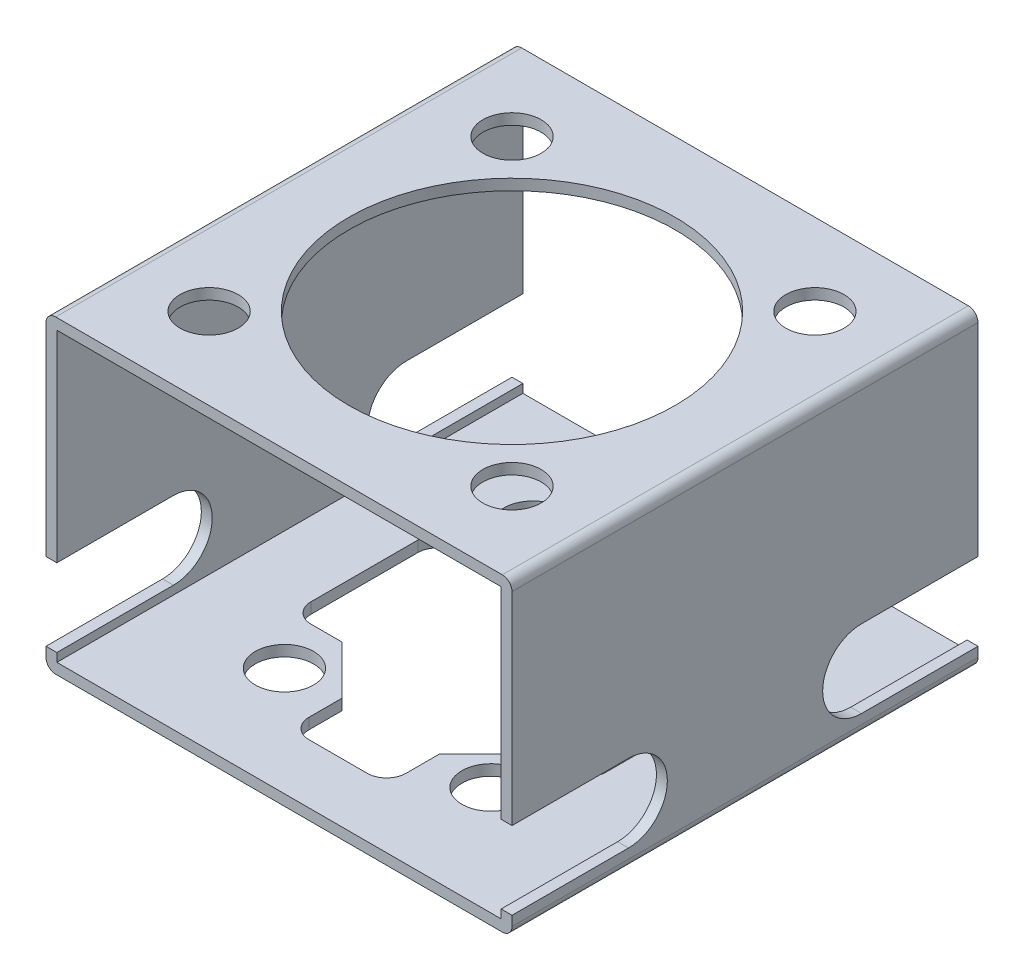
ISO-10303-21;
HEADER;
FILE_DESCRIPTION(('STEP AP214'),'2;1');
FILE_NAME('part.step','',(''),(''),'','','');
FILE_SCHEMA(('AUTOMOTIVE_DESIGN { 1 0 10303 214 1 1 1 1 }'));
ENDSEC;
DATA;
#1=APPLICATION_CONTEXT('core data for automotive mechanical design processes');
#2=APPLICATION_PROTOCOL_DEFINITION('international standard','automotive_design',2000,#1);
#3=PRODUCT_CONTEXT('',#1,'mechanical');
#4=PRODUCT('Part','Part','',(#3));
#5=PRODUCT_RELATED_PRODUCT_CATEGORY('part','',(#4));
#6=PRODUCT_DEFINITION_FORMATION('','',#4);
#7=PRODUCT_DEFINITION_CONTEXT('part definition',#1,'design');
#8=PRODUCT_DEFINITION('design','',#6,#7);
#9=PRODUCT_DEFINITION_SHAPE('','',#8);
#10=(LENGTH_UNIT() NAMED_UNIT(*) SI_UNIT(.MILLI.,.METRE.));
#11=(NAMED_UNIT(*) PLANE_ANGLE_UNIT() SI_UNIT($,.RADIAN.));
#12=(NAMED_UNIT(*) SI_UNIT($,.STERADIAN.) SOLID_ANGLE_UNIT());
#13=UNCERTAINTY_MEASURE_WITH_UNIT(LENGTH_MEASURE(1.E-05),#10,'distance_accuracy_value','');
#14=(GEOMETRIC_REPRESENTATION_CONTEXT(3) GLOBAL_UNCERTAINTY_ASSIGNED_CONTEXT((#13)) GLOBAL_UNIT_ASSIGNED_CONTEXT((#10,
#11,#12)) REPRESENTATION_CONTEXT('',''));
#15=CARTESIAN_POINT('',(0.,0.,0.));
#16=DIRECTION('',(0.,0.,1.));
#17=DIRECTION('',(1.,0.,0.));
#18=AXIS2_PLACEMENT_3D('',#15,#16,#17);
#19=CARTESIAN_POINT('',(1.5875,49.0093,-38.1));
#20=DIRECTION('',(0.,0.,1.));
#21=DIRECTION('',(1.,0.,0.));
#22=AXIS2_PLACEMENT_3D('',#19,#20,#21);
#23=PLANE('',#22);
#24=DIRECTION('',(0.,-1.,0.));
#25=VECTOR('',#24,1.);
#26=CARTESIAN_POINT('',(0.,1.58750000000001,-38.1));
#27=LINE('',#26,#25);
#28=CARTESIAN_POINT('',(0.,3.17499999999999,-38.1));
#29=VERTEX_POINT('',#28);
#30=CARTESIAN_POINT('',(0.,1.58750000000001,-38.1));
#31=VERTEX_POINT('',#30);
#32=EDGE_CURVE('E650',#29,#31,#27,.T.);
#33=ORIENTED_EDGE('',*,*,#32,.F.);
#34=DIRECTION('',(1.,0.,0.));
#35=VECTOR('',#34,1.);
#36=CARTESIAN_POINT('',(1.5875,3.175,-38.1));
#37=LINE('',#36,#35);
#38=CARTESIAN_POINT('',(1.77800000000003,3.17499999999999,-38.1));
#39=VERTEX_POINT('',#38);
#40=EDGE_CURVE('E726',#29,#39,#37,.T.);
#41=ORIENTED_EDGE('',*,*,#40,.T.);
#42=DIRECTION('',(0.,-1.,0.));
#43=VECTOR('',#42,1.);
#44=CARTESIAN_POINT('',(1.778,1.778,-38.1));
#45=LINE('',#44,#43);
#46=CARTESIAN_POINT('',(1.778,1.778,-38.1));
#47=VERTEX_POINT('',#46);
#48=EDGE_CURVE('E613',#39,#47,#45,.T.);
#49=ORIENTED_EDGE('',*,*,#48,.T.);
#50=DIRECTION('',(1.,0.,0.));
#51=VECTOR('',#50,1.);
#52=CARTESIAN_POINT('',(1.778,1.778,-38.1));
#53=LINE('',#52,#51);
#54=CARTESIAN_POINT('',(74.422,1.778,-38.1));
#55=VERTEX_POINT('',#54);
#56=EDGE_CURVE('E612',#47,#55,#53,.T.);
#57=ORIENTED_EDGE('',*,*,#56,.T.);
#58=DIRECTION('',(0.,1.,0.));
#59=VECTOR('',#58,1.);
#60=CARTESIAN_POINT('',(74.422,1.778,-38.1));
#61=LINE('',#60,#59);
#62=CARTESIAN_POINT('',(74.422,3.17499999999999,-38.1));
#63=VERTEX_POINT('',#62);
#64=EDGE_CURVE('E617',#55,#63,#61,.T.);
#65=ORIENTED_EDGE('',*,*,#64,.T.);
#66=DIRECTION('',(-1.,0.,0.));
#67=VECTOR('',#66,1.);
#68=CARTESIAN_POINT('',(76.2,3.17499999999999,-38.1));
#69=LINE('',#68,#67);
#70=CARTESIAN_POINT('',(76.2,3.17499999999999,-38.1));
#71=VERTEX_POINT('',#70);
#72=EDGE_CURVE('E552',#71,#63,#69,.T.);
#73=ORIENTED_EDGE('',*,*,#72,.F.);
#74=DIRECTION('',(0.,1.,0.));
#75=VECTOR('',#74,1.);
#76=CARTESIAN_POINT('',(76.2,1.58750000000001,-38.1));
#77=LINE('',#76,#75);
#78=CARTESIAN_POINT('',(76.2,1.58750000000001,-38.1));
#79=VERTEX_POINT('',#78);
#80=EDGE_CURVE('E665',#79,#71,#77,.T.);
#81=ORIENTED_EDGE('',*,*,#80,.F.);
#82=CARTESIAN_POINT('',(74.6125,1.5875,-38.1));
#83=DIRECTION('',(0.,0.,1.));
#84=DIRECTION('',(1.,0.,0.));
#85=AXIS2_PLACEMENT_3D('',#82,#83,#84);
#86=CIRCLE('',#85,1.5875);
#87=CARTESIAN_POINT('',(74.6125,0.,-38.1));
#88=VERTEX_POINT('',#87);
#89=EDGE_CURVE('E661',#88,#79,#86,.T.);
#90=ORIENTED_EDGE('',*,*,#89,.F.);
#91=DIRECTION('',(1.,0.,0.));
#92=VECTOR('',#91,1.);
#93=CARTESIAN_POINT('',(1.58750000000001,0.,-38.1));
#94=LINE('',#93,#92);
#95=CARTESIAN_POINT('',(1.58750000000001,0.,-38.1));
#96=VERTEX_POINT('',#95);
#97=EDGE_CURVE('E658',#96,#88,#94,.T.);
#98=ORIENTED_EDGE('',*,*,#97,.F.);
#99=CARTESIAN_POINT('',(1.5875,1.5875,-38.1));
#100=DIRECTION('',(0.,0.,1.));
#101=DIRECTION('',(-1.,0.,0.));
#102=AXIS2_PLACEMENT_3D('',#99,#100,#101);
#103=CIRCLE('',#102,1.5875);
#104=EDGE_CURVE('E655',#31,#96,#103,.T.);
#105=ORIENTED_EDGE('',*,*,#104,.F.);
#106=EDGE_LOOP('',(#33,#41,#49,#57,#65,#73,#81,#90,#98,#105));
#107=FACE_BOUND('',#106,.T.);
#108=ADVANCED_FACE('F30',(#107),#23,.F.);
#109=CARTESIAN_POINT('',(76.2,1.58750000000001,-38.1));
#110=DIRECTION('',(1.,0.,0.));
#111=DIRECTION('',(0.,0.,-1.));
#112=AXIS2_PLACEMENT_3D('',#109,#110,#111);
#113=PLANE('',#112);
#114=DIRECTION('',(0.,0.,1.));
#115=VECTOR('',#114,1.);
#116=CARTESIAN_POINT('',(76.2,3.175,-19.05));
#117=LINE('',#116,#115);
#118=CARTESIAN_POINT('',(76.2,3.175,-19.05));
#119=VERTEX_POINT('',#118);
#120=EDGE_CURVE('E532',#71,#119,#117,.T.);
#121=ORIENTED_EDGE('',*,*,#120,.T.);
#122=CARTESIAN_POINT('',(76.2,9.525,-19.05));
#123=DIRECTION('',(-1.,0.,0.));
#124=DIRECTION('',(0.,0.,1.));
#125=AXIS2_PLACEMENT_3D('',#122,#123,#124);
#126=CIRCLE('',#125,6.35);
#127=CARTESIAN_POINT('',(76.2,15.875,-19.05));
#128=VERTEX_POINT('',#127);
#129=EDGE_CURVE('E529',#119,#128,#126,.T.);
#130=ORIENTED_EDGE('',*,*,#129,.T.);
#131=DIRECTION('',(0.,0.,-1.));
#132=VECTOR('',#131,1.);
#133=CARTESIAN_POINT('',(76.2,15.875,-38.1));
#134=LINE('',#133,#132);
#135=CARTESIAN_POINT('',(76.2,15.875,-38.1));
#136=VERTEX_POINT('',#135);
#137=EDGE_CURVE('E536',#128,#136,#134,.T.);
#138=ORIENTED_EDGE('',*,*,#137,.T.);
#139=CARTESIAN_POINT('',(76.2,49.0093,-38.1));
#140=VERTEX_POINT('',#139);
#141=EDGE_CURVE('E664',#136,#140,#77,.T.);
#142=ORIENTED_EDGE('',*,*,#141,.T.);
#143=DIRECTION('',(0.,0.,1.));
#144=VECTOR('',#143,1.);
#145=CARTESIAN_POINT('',(76.2,49.0093,-38.1));
#146=LINE('',#145,#144);
#147=CARTESIAN_POINT('',(76.2,49.0093,38.1));
#148=VERTEX_POINT('',#147);
#149=EDGE_CURVE('E704',#140,#148,#146,.T.);
#150=ORIENTED_EDGE('',*,*,#149,.T.);
#151=DIRECTION('',(0.,1.,0.));
#152=VECTOR('',#151,1.);
#153=CARTESIAN_POINT('',(76.2,1.58750000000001,38.1));
#154=LINE('',#153,#152);
#155=CARTESIAN_POINT('',(76.2,15.875,38.1));
#156=VERTEX_POINT('',#155);
#157=EDGE_CURVE('E690',#156,#148,#154,.T.);
#158=ORIENTED_EDGE('',*,*,#157,.F.);
#159=DIRECTION('',(0.,0.,1.));
#160=VECTOR('',#159,1.);
#161=CARTESIAN_POINT('',(76.2,15.875,38.1));
#162=LINE('',#161,#160);
#163=CARTESIAN_POINT('',(76.2,15.875,19.05));
#164=VERTEX_POINT('',#163);
#165=EDGE_CURVE('E576',#164,#156,#162,.T.);
#166=ORIENTED_EDGE('',*,*,#165,.F.);
#167=CARTESIAN_POINT('',(76.2,9.525,19.05));
#168=DIRECTION('',(1.,0.,0.));
#169=DIRECTION('',(0.,0.,-1.));
#170=AXIS2_PLACEMENT_3D('',#167,#168,#169);
#171=CIRCLE('',#170,6.35);
#172=CARTESIAN_POINT('',(76.2,3.175,19.05));
#173=VERTEX_POINT('',#172);
#174=EDGE_CURVE('E574',#173,#164,#171,.T.);
#175=ORIENTED_EDGE('',*,*,#174,.F.);
#176=DIRECTION('',(0.,0.,-1.));
#177=VECTOR('',#176,1.);
#178=CARTESIAN_POINT('',(76.2,3.175,19.05));
#179=LINE('',#178,#177);
#180=CARTESIAN_POINT('',(76.2,3.17499999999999,38.1));
#181=VERTEX_POINT('',#180);
#182=EDGE_CURVE('E579',#181,#173,#179,.T.);
#183=ORIENTED_EDGE('',*,*,#182,.F.);
#184=CARTESIAN_POINT('',(76.2,1.58750000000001,38.1));
#185=VERTEX_POINT('',#184);
#186=EDGE_CURVE('E691',#185,#181,#154,.T.);
#187=ORIENTED_EDGE('',*,*,#186,.F.);
#188=DIRECTION('',(0.,0.,1.));
#189=VECTOR('',#188,1.);
#190=CARTESIAN_POINT('',(76.2,1.58750000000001,-38.1));
#191=LINE('',#190,#189);
#192=EDGE_CURVE('E707',#79,#185,#191,.T.);
#193=ORIENTED_EDGE('',*,*,#192,.F.);
#194=ORIENTED_EDGE('',*,*,#80,.T.);
#195=EDGE_LOOP('',(#121,#130,#138,#142,#150,#158,#166,#175,#183,#187,#193,#194));
#196=FACE_BOUND('',#195,.T.);
#197=ADVANCED_FACE('F814',(#196),#113,.T.);
#198=CARTESIAN_POINT('',(0.,1.58750000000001,-38.1));
#199=DIRECTION('',(-1.,0.,0.));
#200=DIRECTION('',(0.,0.,1.));
#201=AXIS2_PLACEMENT_3D('',#198,#199,#200);
#202=PLANE('',#201);
#203=DIRECTION('',(0.,0.,1.));
#204=VECTOR('',#203,1.);
#205=CARTESIAN_POINT('',(0.,3.175,-19.05));
#206=LINE('',#205,#204);
#207=CARTESIAN_POINT('',(0.,3.175,-19.05));
#208=VERTEX_POINT('',#207);
#209=EDGE_CURVE('E542',#29,#208,#206,.T.);
#210=ORIENTED_EDGE('',*,*,#209,.F.);
#211=ORIENTED_EDGE('',*,*,#32,.T.);
#212=DIRECTION('',(0.,0.,1.));
#213=VECTOR('',#212,1.);
#214=CARTESIAN_POINT('',(0.,1.58750000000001,-38.1));
#215=LINE('',#214,#213);
#216=CARTESIAN_POINT('',(0.,1.58750000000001,38.1));
#217=VERTEX_POINT('',#216);
#218=EDGE_CURVE('E713',#31,#217,#215,.T.);
#219=ORIENTED_EDGE('',*,*,#218,.T.);
#220=DIRECTION('',(0.,-1.,0.));
#221=VECTOR('',#220,1.);
#222=CARTESIAN_POINT('',(0.,1.58750000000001,38.1));
#223=LINE('',#222,#221);
#224=CARTESIAN_POINT('',(0.,3.17499999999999,38.1));
#225=VERTEX_POINT('',#224);
#226=EDGE_CURVE('E677',#225,#217,#223,.T.);
#227=ORIENTED_EDGE('',*,*,#226,.F.);
#228=DIRECTION('',(0.,0.,-1.));
#229=VECTOR('',#228,1.);
#230=CARTESIAN_POINT('',(0.,3.175,19.05));
#231=LINE('',#230,#229);
#232=CARTESIAN_POINT('',(0.,3.175,19.05));
#233=VERTEX_POINT('',#232);
#234=EDGE_CURVE('E577',#225,#233,#231,.T.);
#235=ORIENTED_EDGE('',*,*,#234,.T.);
#236=CARTESIAN_POINT('',(0.,9.525,19.05));
#237=DIRECTION('',(1.,0.,0.));
#238=DIRECTION('',(0.,0.,-1.));
#239=AXIS2_PLACEMENT_3D('',#236,#237,#238);
#240=CIRCLE('',#239,6.35);
#241=CARTESIAN_POINT('',(0.,15.875,19.05));
#242=VERTEX_POINT('',#241);
#243=EDGE_CURVE('E573',#233,#242,#240,.T.);
#244=ORIENTED_EDGE('',*,*,#243,.T.);
#245=DIRECTION('',(0.,0.,1.));
#246=VECTOR('',#245,1.);
#247=CARTESIAN_POINT('',(0.,15.875,38.1));
#248=LINE('',#247,#246);
#249=CARTESIAN_POINT('',(0.,15.875,38.1));
#250=VERTEX_POINT('',#249);
#251=EDGE_CURVE('E584',#242,#250,#248,.T.);
#252=ORIENTED_EDGE('',*,*,#251,.T.);
#253=CARTESIAN_POINT('',(0.,49.0093,38.1));
#254=VERTEX_POINT('',#253);
#255=EDGE_CURVE('E678',#254,#250,#223,.T.);
#256=ORIENTED_EDGE('',*,*,#255,.F.);
#257=DIRECTION('',(0.,0.,1.));
#258=VECTOR('',#257,1.);
#259=CARTESIAN_POINT('',(0.,49.0093,-38.1));
#260=LINE('',#259,#258);
#261=CARTESIAN_POINT('',(0.,49.0093,-38.1));
#262=VERTEX_POINT('',#261);
#263=EDGE_CURVE('E674',#262,#254,#260,.T.);
#264=ORIENTED_EDGE('',*,*,#263,.F.);
#265=CARTESIAN_POINT('',(0.,15.875,-38.1));
#266=VERTEX_POINT('',#265);
#267=EDGE_CURVE('E652',#262,#266,#27,.T.);
#268=ORIENTED_EDGE('',*,*,#267,.T.);
#269=DIRECTION('',(0.,0.,-1.));
#270=VECTOR('',#269,1.);
#271=CARTESIAN_POINT('',(0.,15.875,-38.1));
#272=LINE('',#271,#270);
#273=CARTESIAN_POINT('',(0.,15.875,-19.05));
#274=VERTEX_POINT('',#273);
#275=EDGE_CURVE('E533',#274,#266,#272,.T.);
#276=ORIENTED_EDGE('',*,*,#275,.F.);
#277=CARTESIAN_POINT('',(0.,9.525,-19.05));
#278=DIRECTION('',(-1.,0.,0.));
#279=DIRECTION('',(0.,0.,1.));
#280=AXIS2_PLACEMENT_3D('',#277,#278,#279);
#281=CIRCLE('',#280,6.35);
#282=EDGE_CURVE('E526',#208,#274,#281,.T.);
#283=ORIENTED_EDGE('',*,*,#282,.F.);
#284=EDGE_LOOP('',(#210,#211,#219,#227,#235,#244,#252,#256,#264,#268,#276,#283));
#285=FACE_BOUND('',#284,.T.);
#286=ADVANCED_FACE('F821',(#285),#202,.T.);
#287=CARTESIAN_POINT('',(1.5875,49.0093,38.1));
#288=DIRECTION('',(0.,0.,1.));
#289=DIRECTION('',(1.,0.,0.));
#290=AXIS2_PLACEMENT_3D('',#287,#288,#289);
#291=PLANE('',#290);
#292=ORIENTED_EDGE('',*,*,#255,.T.);
#293=DIRECTION('',(-1.,0.,0.));
#294=VECTOR('',#293,1.);
#295=CARTESIAN_POINT('',(76.2,15.875,38.1));
#296=LINE('',#295,#294);
#297=CARTESIAN_POINT('',(1.77800000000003,15.875,38.1));
#298=VERTEX_POINT('',#297);
#299=EDGE_CURVE('E595',#298,#250,#296,.T.);
#300=ORIENTED_EDGE('',*,*,#299,.F.);
#301=DIRECTION('',(0.,-1.,0.));
#302=VECTOR('',#301,1.);
#303=CARTESIAN_POINT('',(1.778,1.778,38.1));
#304=LINE('',#303,#302);
#305=CARTESIAN_POINT('',(1.778,48.8188,38.1));
#306=VERTEX_POINT('',#305);
#307=EDGE_CURVE('E624',#306,#298,#304,.T.);
#308=ORIENTED_EDGE('',*,*,#307,.F.);
#309=DIRECTION('',(-1.,0.,0.));
#310=VECTOR('',#309,1.);
#311=CARTESIAN_POINT('',(1.778,48.8188,38.1));
#312=LINE('',#311,#310);
#313=CARTESIAN_POINT('',(74.422,48.8188,38.1));
#314=VERTEX_POINT('',#313);
#315=EDGE_CURVE('E634',#314,#306,#312,.T.);
#316=ORIENTED_EDGE('',*,*,#315,.F.);
#317=DIRECTION('',(0.,1.,0.));
#318=VECTOR('',#317,1.);
#319=CARTESIAN_POINT('',(74.422,1.778,38.1));
#320=LINE('',#319,#318);
#321=CARTESIAN_POINT('',(74.422,15.875,38.1));
#322=VERTEX_POINT('',#321);
#323=EDGE_CURVE('E630',#322,#314,#320,.T.);
#324=ORIENTED_EDGE('',*,*,#323,.F.);
#325=EDGE_CURVE('E596',#156,#322,#296,.T.);
#326=ORIENTED_EDGE('',*,*,#325,.F.);
#327=ORIENTED_EDGE('',*,*,#157,.T.);
#328=CARTESIAN_POINT('',(74.6125,49.0093,38.1));
#329=DIRECTION('',(0.,0.,1.));
#330=DIRECTION('',(1.,0.,0.));
#331=AXIS2_PLACEMENT_3D('',#328,#329,#330);
#332=CIRCLE('',#331,1.5875);
#333=CARTESIAN_POINT('',(74.6125,50.5968,38.1));
#334=VERTEX_POINT('',#333);
#335=EDGE_CURVE('E694',#148,#334,#332,.T.);
#336=ORIENTED_EDGE('',*,*,#335,.T.);
#337=DIRECTION('',(-1.,0.,0.));
#338=VECTOR('',#337,1.);
#339=CARTESIAN_POINT('',(1.5875,50.5968,38.1));
#340=LINE('',#339,#338);
#341=CARTESIAN_POINT('',(1.5875,50.5968,38.1));
#342=VERTEX_POINT('',#341);
#343=EDGE_CURVE('E651',#334,#342,#340,.T.);
#344=ORIENTED_EDGE('',*,*,#343,.T.);
#345=CARTESIAN_POINT('',(1.5875,49.0093,38.1));
#346=DIRECTION('',(0.,0.,1.));
#347=DIRECTION('',(1.,0.,0.));
#348=AXIS2_PLACEMENT_3D('',#345,#346,#347);
#349=CIRCLE('',#348,1.5875);
#350=EDGE_CURVE('E639',#342,#254,#349,.T.);
#351=ORIENTED_EDGE('',*,*,#350,.T.);
#352=EDGE_LOOP('',(#292,#300,#308,#316,#324,#326,#327,#336,#344,#351));
#353=FACE_BOUND('',#352,.T.);
#354=ADVANCED_FACE('F851',(#353),#291,.T.);
#355=ORIENTED_EDGE('',*,*,#186,.T.);
#356=DIRECTION('',(-1.,0.,0.));
#357=VECTOR('',#356,1.);
#358=CARTESIAN_POINT('',(76.2,3.17499999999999,38.1));
#359=LINE('',#358,#357);
#360=CARTESIAN_POINT('',(74.422,3.17499999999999,38.1));
#361=VERTEX_POINT('',#360);
#362=EDGE_CURVE('E592',#181,#361,#359,.T.);
#363=ORIENTED_EDGE('',*,*,#362,.T.);
#364=CARTESIAN_POINT('',(74.422,1.778,38.1));
#365=VERTEX_POINT('',#364);
#366=EDGE_CURVE('E631',#365,#361,#320,.T.);
#367=ORIENTED_EDGE('',*,*,#366,.F.);
#368=DIRECTION('',(1.,0.,0.));
#369=VECTOR('',#368,1.);
#370=CARTESIAN_POINT('',(1.778,1.778,38.1));
#371=LINE('',#370,#369);
#372=CARTESIAN_POINT('',(1.778,1.778,38.1));
#373=VERTEX_POINT('',#372);
#374=EDGE_CURVE('E627',#373,#365,#371,.T.);
#375=ORIENTED_EDGE('',*,*,#374,.F.);
#376=CARTESIAN_POINT('',(1.778,3.175,38.1));
#377=VERTEX_POINT('',#376);
#378=EDGE_CURVE('E608',#377,#373,#304,.T.);
#379=ORIENTED_EDGE('',*,*,#378,.F.);
#380=EDGE_CURVE('E591',#377,#225,#359,.T.);
#381=ORIENTED_EDGE('',*,*,#380,.T.);
#382=ORIENTED_EDGE('',*,*,#226,.T.);
#383=CARTESIAN_POINT('',(1.5875,1.5875,38.1));
#384=DIRECTION('',(0.,0.,1.));
#385=DIRECTION('',(-1.,0.,0.));
#386=AXIS2_PLACEMENT_3D('',#383,#384,#385);
#387=CIRCLE('',#386,1.5875);
#388=CARTESIAN_POINT('',(1.58750000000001,0.,38.1));
#389=VERTEX_POINT('',#388);
#390=EDGE_CURVE('E681',#217,#389,#387,.T.);
#391=ORIENTED_EDGE('',*,*,#390,.T.);
#392=DIRECTION('',(1.,0.,0.));
#393=VECTOR('',#392,1.);
#394=CARTESIAN_POINT('',(1.58750000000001,0.,38.1));
#395=LINE('',#394,#393);
#396=CARTESIAN_POINT('',(74.6125,0.,38.1));
#397=VERTEX_POINT('',#396);
#398=EDGE_CURVE('E684',#389,#397,#395,.T.);
#399=ORIENTED_EDGE('',*,*,#398,.T.);
#400=CARTESIAN_POINT('',(74.6125,1.5875,38.1));
#401=DIRECTION('',(0.,0.,1.));
#402=DIRECTION('',(1.,0.,0.));
#403=AXIS2_PLACEMENT_3D('',#400,#401,#402);
#404=CIRCLE('',#403,1.5875);
#405=EDGE_CURVE('E687',#397,#185,#404,.T.);
#406=ORIENTED_EDGE('',*,*,#405,.T.);
#407=EDGE_LOOP('',(#355,#363,#367,#375,#379,#381,#382,#391,#399,#406));
#408=FACE_BOUND('',#407,.T.);
#409=ADVANCED_FACE('F899',(#408),#291,.T.);
#410=CARTESIAN_POINT('',(1.778,1.778,-38.1));
#411=DIRECTION('',(-1.,0.,0.));
#412=DIRECTION('',(0.,0.,1.));
#413=AXIS2_PLACEMENT_3D('',#410,#411,#412);
#414=PLANE('',#413);
#415=ORIENTED_EDGE('',*,*,#48,.F.);
#416=DIRECTION('',(0.,0.,1.));
#417=VECTOR('',#416,1.);
#418=CARTESIAN_POINT('',(1.778,3.17499999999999,-38.1));
#419=LINE('',#418,#417);
#420=CARTESIAN_POINT('',(1.77800000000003,3.175,-19.05));
#421=VERTEX_POINT('',#420);
#422=EDGE_CURVE('E567',#39,#421,#419,.T.);
#423=ORIENTED_EDGE('',*,*,#422,.T.);
#424=CARTESIAN_POINT('',(1.77800000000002,9.525,-19.05));
#425=DIRECTION('',(-1.,0.,0.));
#426=DIRECTION('',(0.,0.,1.));
#427=AXIS2_PLACEMENT_3D('',#424,#425,#426);
#428=CIRCLE('',#427,6.35);
#429=CARTESIAN_POINT('',(1.77800000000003,15.875,-19.05));
#430=VERTEX_POINT('',#429);
#431=EDGE_CURVE('E570',#421,#430,#428,.T.);
#432=ORIENTED_EDGE('',*,*,#431,.T.);
#433=DIRECTION('',(0.,0.,-1.));
#434=VECTOR('',#433,1.);
#435=CARTESIAN_POINT('',(1.778,15.875,-38.1));
#436=LINE('',#435,#434);
#437=CARTESIAN_POINT('',(1.77800000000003,15.875,-38.1));
#438=VERTEX_POINT('',#437);
#439=EDGE_CURVE('E561',#430,#438,#436,.T.);
#440=ORIENTED_EDGE('',*,*,#439,.T.);
#441=CARTESIAN_POINT('',(1.778,48.8188,-38.1));
#442=VERTEX_POINT('',#441);
#443=EDGE_CURVE('E609',#442,#438,#45,.T.);
#444=ORIENTED_EDGE('',*,*,#443,.F.);
#445=DIRECTION('',(0.,0.,1.));
#446=VECTOR('',#445,1.);
#447=CARTESIAN_POINT('',(1.778,48.8188,-38.1));
#448=LINE('',#447,#446);
#449=EDGE_CURVE('E637',#442,#306,#448,.T.);
#450=ORIENTED_EDGE('',*,*,#449,.T.);
#451=ORIENTED_EDGE('',*,*,#307,.T.);
#452=DIRECTION('',(0.,0.,1.));
#453=VECTOR('',#452,1.);
#454=CARTESIAN_POINT('',(1.778,15.875,-38.1));
#455=LINE('',#454,#453);
#456=CARTESIAN_POINT('',(1.77800000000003,15.875,19.05));
#457=VERTEX_POINT('',#456);
#458=EDGE_CURVE('E604',#457,#298,#455,.T.);
#459=ORIENTED_EDGE('',*,*,#458,.F.);
#460=CARTESIAN_POINT('',(1.77800000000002,9.525,19.05));
#461=DIRECTION('',(-1.,0.,0.));
#462=DIRECTION('',(0.,0.,1.));
#463=AXIS2_PLACEMENT_3D('',#460,#461,#462);
#464=CIRCLE('',#463,6.35);
#465=CARTESIAN_POINT('',(1.77800000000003,3.175,19.05));
#466=VERTEX_POINT('',#465);
#467=EDGE_CURVE('E606',#466,#457,#464,.F.);
#468=ORIENTED_EDGE('',*,*,#467,.F.);
#469=DIRECTION('',(0.,0.,-1.));
#470=VECTOR('',#469,1.);
#471=CARTESIAN_POINT('',(1.778,3.175,-38.1));
#472=LINE('',#471,#470);
#473=EDGE_CURVE('E602',#377,#466,#472,.T.);
#474=ORIENTED_EDGE('',*,*,#473,.F.);
#475=ORIENTED_EDGE('',*,*,#378,.T.);
#476=DIRECTION('',(0.,0.,1.));
#477=VECTOR('',#476,1.);
#478=CARTESIAN_POINT('',(1.778,1.778,-38.1));
#479=LINE('',#478,#477);
#480=EDGE_CURVE('E623',#47,#373,#479,.T.);
#481=ORIENTED_EDGE('',*,*,#480,.F.);
#482=EDGE_LOOP('',(#415,#423,#432,#440,#444,#450,#451,#459,#468,#474,#475,#481));
#483=FACE_BOUND('',#482,.T.);
#484=ADVANCED_FACE('F874',(#483),#414,.F.);
#485=CARTESIAN_POINT('',(74.422,1.778,-38.1));
#486=DIRECTION('',(1.,0.,0.));
#487=DIRECTION('',(0.,0.,-1.));
#488=AXIS2_PLACEMENT_3D('',#485,#486,#487);
#489=PLANE('',#488);
#490=CARTESIAN_POINT('',(74.422,9.525,-19.05));
#491=DIRECTION('',(1.,0.,0.));
#492=DIRECTION('',(0.,0.,-1.));
#493=AXIS2_PLACEMENT_3D('',#490,#491,#492);
#494=CIRCLE('',#493,6.35);
#495=CARTESIAN_POINT('',(74.422,15.875,-19.05));
#496=VERTEX_POINT('',#495);
#497=CARTESIAN_POINT('',(74.422,3.175,-19.05));
#498=VERTEX_POINT('',#497);
#499=EDGE_CURVE('E729',#496,#498,#494,.T.);
#500=ORIENTED_EDGE('',*,*,#499,.T.);
#501=DIRECTION('',(0.,0.,-1.));
#502=VECTOR('',#501,1.);
#503=CARTESIAN_POINT('',(74.422,3.17499999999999,-38.1));
#504=LINE('',#503,#502);
#505=EDGE_CURVE('E564',#498,#63,#504,.T.);
#506=ORIENTED_EDGE('',*,*,#505,.T.);
#507=ORIENTED_EDGE('',*,*,#64,.F.);
#508=DIRECTION('',(0.,0.,1.));
#509=VECTOR('',#508,1.);
#510=CARTESIAN_POINT('',(74.422,1.778,-38.1));
#511=LINE('',#510,#509);
#512=EDGE_CURVE('E643',#55,#365,#511,.T.);
#513=ORIENTED_EDGE('',*,*,#512,.T.);
#514=ORIENTED_EDGE('',*,*,#366,.T.);
#515=DIRECTION('',(0.,0.,1.));
#516=VECTOR('',#515,1.);
#517=CARTESIAN_POINT('',(74.422,3.175,-38.1));
#518=LINE('',#517,#516);
#519=CARTESIAN_POINT('',(74.422,3.175,19.05));
#520=VERTEX_POINT('',#519);
#521=EDGE_CURVE('E701',#520,#361,#518,.T.);
#522=ORIENTED_EDGE('',*,*,#521,.F.);
#523=CARTESIAN_POINT('',(74.422,9.525,19.05));
#524=DIRECTION('',(1.,0.,0.));
#525=DIRECTION('',(0.,0.,-1.));
#526=AXIS2_PLACEMENT_3D('',#523,#524,#525);
#527=CIRCLE('',#526,6.35);
#528=CARTESIAN_POINT('',(74.422,15.875,19.05));
#529=VERTEX_POINT('',#528);
#530=EDGE_CURVE('E718',#529,#520,#527,.F.);
#531=ORIENTED_EDGE('',*,*,#530,.F.);
#532=DIRECTION('',(0.,0.,-1.));
#533=VECTOR('',#532,1.);
#534=CARTESIAN_POINT('',(74.422,15.875,-38.1));
#535=LINE('',#534,#533);
#536=EDGE_CURVE('E721',#322,#529,#535,.T.);
#537=ORIENTED_EDGE('',*,*,#536,.F.);
#538=ORIENTED_EDGE('',*,*,#323,.T.);
#539=DIRECTION('',(0.,0.,1.));
#540=VECTOR('',#539,1.);
#541=CARTESIAN_POINT('',(74.422,48.8188,-38.1));
#542=LINE('',#541,#540);
#543=CARTESIAN_POINT('',(74.422,48.8188,-38.1));
#544=VERTEX_POINT('',#543);
#545=EDGE_CURVE('E640',#544,#314,#542,.T.);
#546=ORIENTED_EDGE('',*,*,#545,.F.);
#547=CARTESIAN_POINT('',(74.422,15.875,-38.1));
#548=VERTEX_POINT('',#547);
#549=EDGE_CURVE('E616',#548,#544,#61,.T.);
#550=ORIENTED_EDGE('',*,*,#549,.F.);
#551=DIRECTION('',(0.,0.,1.));
#552=VECTOR('',#551,1.);
#553=CARTESIAN_POINT('',(74.422,15.875,-38.1));
#554=LINE('',#553,#552);
#555=EDGE_CURVE('E558',#548,#496,#554,.T.);
#556=ORIENTED_EDGE('',*,*,#555,.T.);
#557=EDGE_LOOP('',(#500,#506,#507,#513,#514,#522,#531,#537,#538,#546,#550,#556));
#558=FACE_BOUND('',#557,.T.);
#559=ADVANCED_FACE('F883',(#558),#489,.F.);
#560=CARTESIAN_POINT('',(1.5875,49.0093,-38.1));
#561=DIRECTION('',(0.,0.,1.));
#562=DIRECTION('',(1.,0.,0.));
#563=AXIS2_PLACEMENT_3D('',#560,#561,#562);
#564=CYLINDRICAL_SURFACE('',#563,1.5875);
#565=ORIENTED_EDGE('',*,*,#350,.F.);
#566=DIRECTION('',(0.,0.,1.));
#567=VECTOR('',#566,1.);
#568=CARTESIAN_POINT('',(1.5875,50.5968,-38.1));
#569=LINE('',#568,#567);
#570=CARTESIAN_POINT('',(1.5875,50.5968,-38.1));
#571=VERTEX_POINT('',#570);
#572=EDGE_CURVE('E699',#571,#342,#569,.T.);
#573=ORIENTED_EDGE('',*,*,#572,.F.);
#574=CARTESIAN_POINT('',(1.5875,49.0093,-38.1));
#575=DIRECTION('',(0.,0.,1.));
#576=DIRECTION('',(1.,0.,0.));
#577=AXIS2_PLACEMENT_3D('',#574,#575,#576);
#578=CIRCLE('',#577,1.5875);
#579=EDGE_CURVE('E647',#571,#262,#578,.T.);
#580=ORIENTED_EDGE('',*,*,#579,.T.);
#581=ORIENTED_EDGE('',*,*,#263,.T.);
#582=EDGE_LOOP('',(#565,#573,#580,#581));
#583=FACE_BOUND('',#582,.T.);
#584=ADVANCED_FACE('F858',(#583),#564,.T.);
#585=CARTESIAN_POINT('',(1.5875,50.5968,-38.1));
#586=DIRECTION('',(0.,1.,0.));
#587=DIRECTION('',(0.,0.,1.));
#588=AXIS2_PLACEMENT_3D('',#585,#586,#587);
#589=PLANE('',#588);
#590=CARTESIAN_POINT('',(13.335,50.5968,24.765));
#591=DIRECTION('',(0.,1.,0.));
#592=DIRECTION('',(0.,0.,1.));
#593=AXIS2_PLACEMENT_3D('',#590,#591,#592);
#594=CIRCLE('',#593,4.7625);
#595=CARTESIAN_POINT('',(13.335,50.5968,29.5275));
#596=VERTEX_POINT('',#595);
#597=EDGE_CURVE('E496',#596,#596,#594,.T.);
#598=ORIENTED_EDGE('',*,*,#597,.F.);
#599=EDGE_LOOP('',(#598));
#600=FACE_BOUND('',#599,.T.);
#601=CARTESIAN_POINT('',(62.865,50.5968,24.765));
#602=DIRECTION('',(0.,1.,0.));
#603=DIRECTION('',(0.,0.,1.));
#604=AXIS2_PLACEMENT_3D('',#601,#602,#603);
#605=CIRCLE('',#604,4.7625);
#606=CARTESIAN_POINT('',(62.865,50.5968,29.5275));
#607=VERTEX_POINT('',#606);
#608=EDGE_CURVE('E502',#607,#607,#605,.T.);
#609=ORIENTED_EDGE('',*,*,#608,.F.);
#610=EDGE_LOOP('',(#609));
#611=FACE_BOUND('',#610,.T.);
#612=CARTESIAN_POINT('',(62.865,50.5968,-24.765));
#613=DIRECTION('',(0.,1.,0.));
#614=DIRECTION('',(0.,0.,1.));
#615=AXIS2_PLACEMENT_3D('',#612,#613,#614);
#616=CIRCLE('',#615,4.7625);
#617=CARTESIAN_POINT('',(62.865,50.5968,-20.0025));
#618=VERTEX_POINT('',#617);
#619=EDGE_CURVE('E508',#618,#618,#616,.T.);
#620=ORIENTED_EDGE('',*,*,#619,.F.);
#621=EDGE_LOOP('',(#620));
#622=FACE_BOUND('',#621,.T.);
#623=CARTESIAN_POINT('',(13.335,50.5968,-24.765));
#624=DIRECTION('',(0.,1.,0.));
#625=DIRECTION('',(0.,0.,1.));
#626=AXIS2_PLACEMENT_3D('',#623,#624,#625);
#627=CIRCLE('',#626,4.7625);
#628=CARTESIAN_POINT('',(13.335,50.5968,-20.0025));
#629=VERTEX_POINT('',#628);
#630=EDGE_CURVE('E514',#629,#629,#627,.T.);
#631=ORIENTED_EDGE('',*,*,#630,.F.);
#632=EDGE_LOOP('',(#631));
#633=FACE_BOUND('',#632,.T.);
#634=CARTESIAN_POINT('',(38.1,50.5968,0.));
#635=DIRECTION('',(0.,1.,0.));
#636=DIRECTION('',(0.,0.,1.));
#637=AXIS2_PLACEMENT_3D('',#634,#635,#636);
#638=CIRCLE('',#637,26.67);
#639=CARTESIAN_POINT('',(38.1,50.5968,26.67));
#640=VERTEX_POINT('',#639);
#641=EDGE_CURVE('E520',#640,#640,#638,.T.);
#642=ORIENTED_EDGE('',*,*,#641,.F.);
#643=EDGE_LOOP('',(#642));
#644=FACE_BOUND('',#643,.T.);
#645=ORIENTED_EDGE('',*,*,#343,.F.);
#646=DIRECTION('',(0.,0.,1.));
#647=VECTOR('',#646,1.);
#648=CARTESIAN_POINT('',(74.6125,50.5968,-38.1));
#649=LINE('',#648,#647);
#650=CARTESIAN_POINT('',(74.6125,50.5968,-38.1));
#651=VERTEX_POINT('',#650);
#652=EDGE_CURVE('E702',#651,#334,#649,.T.);
#653=ORIENTED_EDGE('',*,*,#652,.F.);
#654=DIRECTION('',(-1.,0.,0.));
#655=VECTOR('',#654,1.);
#656=CARTESIAN_POINT('',(1.5875,50.5968,-38.1));
#657=LINE('',#656,#655);
#658=EDGE_CURVE('E671',#651,#571,#657,.T.);
#659=ORIENTED_EDGE('',*,*,#658,.T.);
#660=ORIENTED_EDGE('',*,*,#572,.T.);
#661=EDGE_LOOP('',(#645,#653,#659,#660));
#662=FACE_BOUND('',#661,.T.);
#663=ADVANCED_FACE('F854',(#600,#611,#622,#633,#644,#662),#589,.T.);
#664=CARTESIAN_POINT('',(74.6125,49.0093,-38.1));
#665=DIRECTION('',(0.,0.,1.));
#666=DIRECTION('',(1.,0.,0.));
#667=AXIS2_PLACEMENT_3D('',#664,#665,#666);
#668=CYLINDRICAL_SURFACE('',#667,1.5875);
#669=ORIENTED_EDGE('',*,*,#335,.F.);
#670=ORIENTED_EDGE('',*,*,#149,.F.);
#671=CARTESIAN_POINT('',(74.6125,49.0093,-38.1));
#672=DIRECTION('',(0.,0.,1.));
#673=DIRECTION('',(1.,0.,0.));
#674=AXIS2_PLACEMENT_3D('',#671,#672,#673);
#675=CIRCLE('',#674,1.5875);
#676=EDGE_CURVE('E668',#140,#651,#675,.T.);
#677=ORIENTED_EDGE('',*,*,#676,.T.);
#678=ORIENTED_EDGE('',*,*,#652,.T.);
#679=EDGE_LOOP('',(#669,#670,#677,#678));
#680=FACE_BOUND('',#679,.T.);
#681=ADVANCED_FACE('F848',(#680),#668,.T.);
#682=CARTESIAN_POINT('',(74.6125,1.5875,-38.1));
#683=DIRECTION('',(0.,0.,1.));
#684=DIRECTION('',(1.,0.,0.));
#685=AXIS2_PLACEMENT_3D('',#682,#683,#684);
#686=CYLINDRICAL_SURFACE('',#685,1.5875);
#687=ORIENTED_EDGE('',*,*,#405,.F.);
#688=DIRECTION('',(0.,0.,1.));
#689=VECTOR('',#688,1.);
#690=CARTESIAN_POINT('',(74.6125,0.,-38.1));
#691=LINE('',#690,#689);
#692=EDGE_CURVE('E709',#88,#397,#691,.T.);
#693=ORIENTED_EDGE('',*,*,#692,.F.);
#694=ORIENTED_EDGE('',*,*,#89,.T.);
#695=ORIENTED_EDGE('',*,*,#192,.T.);
#696=EDGE_LOOP('',(#687,#693,#694,#695));
#697=FACE_BOUND('',#696,.T.);
#698=ADVANCED_FACE('F904',(#697),#686,.T.);
#699=CARTESIAN_POINT('',(1.58750000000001,0.,-38.1));
#700=DIRECTION('',(0.,-1.,0.));
#701=DIRECTION('',(0.,0.,-1.));
#702=AXIS2_PLACEMENT_3D('',#699,#700,#701);
#703=PLANE('',#702);
#704=DIRECTION('',(0.,0.,-1.));
#705=VECTOR('',#704,1.);
#706=CARTESIAN_POINT('',(30.1625,0.,28.4353));
#707=LINE('',#706,#705);
#708=CARTESIAN_POINT('',(30.1625,0.,25.2603));
#709=VERTEX_POINT('',#708);
#710=CARTESIAN_POINT('',(30.1625,0.,19.84375));
#711=VERTEX_POINT('',#710);
#712=EDGE_CURVE('E371',#709,#711,#707,.T.);
#713=ORIENTED_EDGE('',*,*,#712,.F.);
#714=CARTESIAN_POINT('',(33.3375,0.,25.2603));
#715=DIRECTION('',(0.,-1.,0.));
#716=DIRECTION('',(0.,0.,-1.));
#717=AXIS2_PLACEMENT_3D('',#714,#715,#716);
#718=CIRCLE('',#717,3.175);
#719=CARTESIAN_POINT('',(33.3375,0.,28.4353));
#720=VERTEX_POINT('',#719);
#721=EDGE_CURVE('E38',#709,#720,#718,.F.);
#722=ORIENTED_EDGE('',*,*,#721,.T.);
#723=DIRECTION('',(-1.,0.,0.));
#724=VECTOR('',#723,1.);
#725=CARTESIAN_POINT('',(30.1625,0.,28.4353));
#726=LINE('',#725,#724);
#727=CARTESIAN_POINT('',(42.8625,0.,28.4353));
#728=VERTEX_POINT('',#727);
#729=EDGE_CURVE('E365',#728,#720,#726,.T.);
#730=ORIENTED_EDGE('',*,*,#729,.F.);
#731=CARTESIAN_POINT('',(42.8625,0.,25.2603));
#732=DIRECTION('',(0.,-1.,0.));
#733=DIRECTION('',(0.,0.,-1.));
#734=AXIS2_PLACEMENT_3D('',#731,#732,#733);
#735=CIRCLE('',#734,3.175);
#736=CARTESIAN_POINT('',(46.0375,0.,25.2603));
#737=VERTEX_POINT('',#736);
#738=EDGE_CURVE('E783',#728,#737,#735,.F.);
#739=ORIENTED_EDGE('',*,*,#738,.T.);
#740=DIRECTION('',(0.,0.,1.));
#741=VECTOR('',#740,1.);
#742=CARTESIAN_POINT('',(46.0375,0.,28.4353));
#743=LINE('',#742,#741);
#744=CARTESIAN_POINT('',(46.0375,0.,19.84375));
#745=VERTEX_POINT('',#744);
#746=EDGE_CURVE('E453',#745,#737,#743,.T.);
#747=ORIENTED_EDGE('',*,*,#746,.F.);
#748=DIRECTION('',(-0.707106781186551,0.,0.707106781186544));
#749=VECTOR('',#748,1.);
#750=CARTESIAN_POINT('',(46.0375,0.,19.84375));
#751=LINE('',#750,#749);
#752=CARTESIAN_POINT('',(53.9750000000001,0.,11.90625));
#753=VERTEX_POINT('',#752);
#754=EDGE_CURVE('E450',#753,#745,#751,.T.);
#755=ORIENTED_EDGE('',*,*,#754,.F.);
#756=DIRECTION('',(-1.,0.,0.));
#757=VECTOR('',#756,1.);
#758=CARTESIAN_POINT('',(62.23,0.,11.90625));
#759=LINE('',#758,#757);
#760=CARTESIAN_POINT('',(59.055,0.,11.90625));
#761=VERTEX_POINT('',#760);
#762=EDGE_CURVE('E448',#761,#753,#759,.T.);
#763=ORIENTED_EDGE('',*,*,#762,.F.);
#764=CARTESIAN_POINT('',(59.055,0.,8.73124999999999));
#765=DIRECTION('',(0.,-1.,0.));
#766=DIRECTION('',(0.,0.,-1.));
#767=AXIS2_PLACEMENT_3D('',#764,#765,#766);
#768=CIRCLE('',#767,3.175);
#769=CARTESIAN_POINT('',(62.23,0.,8.73124999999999));
#770=VERTEX_POINT('',#769);
#771=EDGE_CURVE('E779',#761,#770,#768,.F.);
#772=ORIENTED_EDGE('',*,*,#771,.T.);
#773=DIRECTION('',(0.,0.,1.));
#774=VECTOR('',#773,1.);
#775=CARTESIAN_POINT('',(62.23,0.,11.90625));
#776=LINE('',#775,#774);
#777=CARTESIAN_POINT('',(62.23,0.,-8.73124999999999));
#778=VERTEX_POINT('',#777);
#779=EDGE_CURVE('E445',#778,#770,#776,.T.);
#780=ORIENTED_EDGE('',*,*,#779,.F.);
#781=CARTESIAN_POINT('',(59.055,0.,-8.73124999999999));
#782=DIRECTION('',(0.,-1.,0.));
#783=DIRECTION('',(0.,0.,-1.));
#784=AXIS2_PLACEMENT_3D('',#781,#782,#783);
#785=CIRCLE('',#784,3.175);
#786=CARTESIAN_POINT('',(59.055,0.,-11.90625));
#787=VERTEX_POINT('',#786);
#788=EDGE_CURVE('E771',#778,#787,#785,.F.);
#789=ORIENTED_EDGE('',*,*,#788,.T.);
#790=DIRECTION('',(1.,0.,0.));
#791=VECTOR('',#790,1.);
#792=CARTESIAN_POINT('',(62.23,0.,-11.90625));
#793=LINE('',#792,#791);
#794=CARTESIAN_POINT('',(53.9750000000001,0.,-11.90625));
#795=VERTEX_POINT('',#794);
#796=EDGE_CURVE('E442',#795,#787,#793,.T.);
#797=ORIENTED_EDGE('',*,*,#796,.F.);
#798=DIRECTION('',(0.707106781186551,0.,0.707106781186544));
#799=VECTOR('',#798,1.);
#800=CARTESIAN_POINT('',(46.0375,0.,-19.84375));
#801=LINE('',#800,#799);
#802=CARTESIAN_POINT('',(46.0375,0.,-19.84375));
#803=VERTEX_POINT('',#802);
#804=EDGE_CURVE('E439',#803,#795,#801,.T.);
#805=ORIENTED_EDGE('',*,*,#804,.F.);
#806=DIRECTION('',(0.,0.,1.));
#807=VECTOR('',#806,1.);
#808=CARTESIAN_POINT('',(46.0375,0.,-28.4353));
#809=LINE('',#808,#807);
#810=CARTESIAN_POINT('',(46.0375,0.,-25.2603));
#811=VERTEX_POINT('',#810);
#812=EDGE_CURVE('E437',#811,#803,#809,.T.);
#813=ORIENTED_EDGE('',*,*,#812,.F.);
#814=CARTESIAN_POINT('',(42.8625,0.,-25.2603));
#815=DIRECTION('',(0.,-1.,0.));
#816=DIRECTION('',(0.,0.,-1.));
#817=AXIS2_PLACEMENT_3D('',#814,#815,#816);
#818=CIRCLE('',#817,3.175);
#819=CARTESIAN_POINT('',(42.8625,0.,-28.4353));
#820=VERTEX_POINT('',#819);
#821=EDGE_CURVE('E775',#811,#820,#818,.F.);
#822=ORIENTED_EDGE('',*,*,#821,.T.);
#823=DIRECTION('',(1.,0.,0.));
#824=VECTOR('',#823,1.);
#825=CARTESIAN_POINT('',(30.1625,0.,-28.4353));
#826=LINE('',#825,#824);
#827=CARTESIAN_POINT('',(33.3375,0.,-28.4353));
#828=VERTEX_POINT('',#827);
#829=EDGE_CURVE('E434',#828,#820,#826,.T.);
#830=ORIENTED_EDGE('',*,*,#829,.F.);
#831=CARTESIAN_POINT('',(33.3375,0.,-25.2603));
#832=DIRECTION('',(0.,-1.,0.));
#833=DIRECTION('',(0.,0.,-1.));
#834=AXIS2_PLACEMENT_3D('',#831,#832,#833);
#835=CIRCLE('',#834,3.175);
#836=CARTESIAN_POINT('',(30.1625,0.,-25.2603));
#837=VERTEX_POINT('',#836);
#838=EDGE_CURVE('E787',#828,#837,#835,.F.);
#839=ORIENTED_EDGE('',*,*,#838,.T.);
#840=DIRECTION('',(0.,0.,-1.));
#841=VECTOR('',#840,1.);
#842=CARTESIAN_POINT('',(30.1625,0.,-28.4353));
#843=LINE('',#842,#841);
#844=CARTESIAN_POINT('',(30.1625,0.,-19.84375));
#845=VERTEX_POINT('',#844);
#846=EDGE_CURVE('E431',#845,#837,#843,.T.);
#847=ORIENTED_EDGE('',*,*,#846,.F.);
#848=DIRECTION('',(0.707106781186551,0.,-0.707106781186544));
#849=VECTOR('',#848,1.);
#850=CARTESIAN_POINT('',(30.1625,0.,-19.84375));
#851=LINE('',#850,#849);
#852=CARTESIAN_POINT('',(22.2249999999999,0.,-11.90625));
#853=VERTEX_POINT('',#852);
#854=EDGE_CURVE('E428',#853,#845,#851,.T.);
#855=ORIENTED_EDGE('',*,*,#854,.F.);
#856=DIRECTION('',(1.,0.,0.));
#857=VECTOR('',#856,1.);
#858=CARTESIAN_POINT('',(13.97,0.,-11.90625));
#859=LINE('',#858,#857);
#860=CARTESIAN_POINT('',(17.145,0.,-11.90625));
#861=VERTEX_POINT('',#860);
#862=EDGE_CURVE('E426',#861,#853,#859,.T.);
#863=ORIENTED_EDGE('',*,*,#862,.F.);
#864=CARTESIAN_POINT('',(17.145,0.,-8.73124999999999));
#865=DIRECTION('',(0.,-1.,0.));
#866=DIRECTION('',(0.,0.,-1.));
#867=AXIS2_PLACEMENT_3D('',#864,#865,#866);
#868=CIRCLE('',#867,3.175);
#869=CARTESIAN_POINT('',(13.97,0.,-8.73125));
#870=VERTEX_POINT('',#869);
#871=EDGE_CURVE('E791',#861,#870,#868,.F.);
#872=ORIENTED_EDGE('',*,*,#871,.T.);
#873=DIRECTION('',(0.,0.,-1.));
#874=VECTOR('',#873,1.);
#875=CARTESIAN_POINT('',(13.97,0.,11.90625));
#876=LINE('',#875,#874);
#877=CARTESIAN_POINT('',(13.97,0.,8.73125));
#878=VERTEX_POINT('',#877);
#879=EDGE_CURVE('E423',#878,#870,#876,.T.);
#880=ORIENTED_EDGE('',*,*,#879,.F.);
#881=CARTESIAN_POINT('',(17.145,0.,8.73125));
#882=DIRECTION('',(0.,-1.,0.));
#883=DIRECTION('',(0.,0.,-1.));
#884=AXIS2_PLACEMENT_3D('',#881,#882,#883);
#885=CIRCLE('',#884,3.175);
#886=CARTESIAN_POINT('',(17.145,0.,11.90625));
#887=VERTEX_POINT('',#886);
#888=EDGE_CURVE('E795',#878,#887,#885,.F.);
#889=ORIENTED_EDGE('',*,*,#888,.T.);
#890=DIRECTION('',(-1.,0.,0.));
#891=VECTOR('',#890,1.);
#892=CARTESIAN_POINT('',(13.97,0.,11.90625));
#893=LINE('',#892,#891);
#894=CARTESIAN_POINT('',(22.2249999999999,0.,11.90625));
#895=VERTEX_POINT('',#894);
#896=EDGE_CURVE('E420',#895,#887,#893,.T.);
#897=ORIENTED_EDGE('',*,*,#896,.F.);
#898=DIRECTION('',(-0.707106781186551,0.,-0.707106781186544));
#899=VECTOR('',#898,1.);
#900=CARTESIAN_POINT('',(30.1625,0.,19.84375));
#901=LINE('',#900,#899);
#902=EDGE_CURVE('E418',#711,#895,#901,.T.);
#903=ORIENTED_EDGE('',*,*,#902,.F.);
#904=EDGE_LOOP('',(#713,#722,#730,#739,#747,#755,#763,#772,#780,#789,#797,#805,#813,#822,#830,
#839,#847,#855,#863,#872,#880,#889,#897,#903));
#905=FACE_BOUND('',#904,.T.);
#906=CARTESIAN_POINT('',(21.209,0.,-20.32));
#907=DIRECTION('',(0.,-1.,0.));
#908=DIRECTION('',(0.,0.,-1.));
#909=AXIS2_PLACEMENT_3D('',#906,#907,#908);
#910=CIRCLE('',#909,4.7625);
#911=CARTESIAN_POINT('',(21.209,0.,-25.0825));
#912=VERTEX_POINT('',#911);
#913=EDGE_CURVE('E460',#912,#912,#910,.T.);
#914=ORIENTED_EDGE('',*,*,#913,.F.);
#915=EDGE_LOOP('',(#914));
#916=FACE_BOUND('',#915,.T.);
#917=CARTESIAN_POINT('',(54.991,0.,-20.32));
#918=DIRECTION('',(0.,-1.,0.));
#919=DIRECTION('',(0.,0.,-1.));
#920=AXIS2_PLACEMENT_3D('',#917,#918,#919);
#921=CIRCLE('',#920,4.7625);
#922=CARTESIAN_POINT('',(54.991,0.,-25.0825));
#923=VERTEX_POINT('',#922);
#924=EDGE_CURVE('E478',#923,#923,#921,.T.);
#925=ORIENTED_EDGE('',*,*,#924,.F.);
#926=EDGE_LOOP('',(#925));
#927=FACE_BOUND('',#926,.T.);
#928=CARTESIAN_POINT('',(54.991,0.,20.32));
#929=DIRECTION('',(0.,-1.,0.));
#930=DIRECTION('',(0.,0.,-1.));
#931=AXIS2_PLACEMENT_3D('',#928,#929,#930);
#932=CIRCLE('',#931,4.7625);
#933=CARTESIAN_POINT('',(54.991,0.,15.5575));
#934=VERTEX_POINT('',#933);
#935=EDGE_CURVE('E484',#934,#934,#932,.T.);
#936=ORIENTED_EDGE('',*,*,#935,.F.);
#937=EDGE_LOOP('',(#936));
#938=FACE_BOUND('',#937,.T.);
#939=CARTESIAN_POINT('',(21.209,0.,20.32));
#940=DIRECTION('',(0.,-1.,0.));
#941=DIRECTION('',(0.,0.,-1.));
#942=AXIS2_PLACEMENT_3D('',#939,#940,#941);
#943=CIRCLE('',#942,4.7625);
#944=CARTESIAN_POINT('',(21.209,0.,15.5575));
#945=VERTEX_POINT('',#944);
#946=EDGE_CURVE('E490',#945,#945,#943,.T.);
#947=ORIENTED_EDGE('',*,*,#946,.F.);
#948=EDGE_LOOP('',(#947));
#949=FACE_BOUND('',#948,.T.);
#950=ORIENTED_EDGE('',*,*,#398,.F.);
#951=DIRECTION('',(0.,0.,1.));
#952=VECTOR('',#951,1.);
#953=CARTESIAN_POINT('',(1.58750000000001,0.,-38.1));
#954=LINE('',#953,#952);
#955=EDGE_CURVE('E711',#96,#389,#954,.T.);
#956=ORIENTED_EDGE('',*,*,#955,.F.);
#957=ORIENTED_EDGE('',*,*,#97,.T.);
#958=ORIENTED_EDGE('',*,*,#692,.T.);
#959=EDGE_LOOP('',(#950,#956,#957,#958));
#960=FACE_BOUND('',#959,.T.);
#961=ADVANCED_FACE('F800',(#905,#916,#927,#938,#949,#960),#703,.T.);
#962=CARTESIAN_POINT('',(1.5875,1.5875,-38.1));
#963=DIRECTION('',(0.,0.,1.));
#964=DIRECTION('',(1.,0.,0.));
#965=AXIS2_PLACEMENT_3D('',#962,#963,#964);
#966=CYLINDRICAL_SURFACE('',#965,1.5875);
#967=ORIENTED_EDGE('',*,*,#390,.F.);
#968=ORIENTED_EDGE('',*,*,#218,.F.);
#969=ORIENTED_EDGE('',*,*,#104,.T.);
#970=ORIENTED_EDGE('',*,*,#955,.T.);
#971=EDGE_LOOP('',(#967,#968,#969,#970));
#972=FACE_BOUND('',#971,.T.);
#973=ADVANCED_FACE('F829',(#972),#966,.T.);
#974=ORIENTED_EDGE('',*,*,#141,.F.);
#975=DIRECTION('',(-1.,0.,0.));
#976=VECTOR('',#975,1.);
#977=CARTESIAN_POINT('',(76.2,15.875,-38.1));
#978=LINE('',#977,#976);
#979=EDGE_CURVE('E549',#136,#548,#978,.T.);
#980=ORIENTED_EDGE('',*,*,#979,.T.);
#981=ORIENTED_EDGE('',*,*,#549,.T.);
#982=DIRECTION('',(-1.,0.,0.));
#983=VECTOR('',#982,1.);
#984=CARTESIAN_POINT('',(1.778,48.8188,-38.1));
#985=LINE('',#984,#983);
#986=EDGE_CURVE('E620',#544,#442,#985,.T.);
#987=ORIENTED_EDGE('',*,*,#986,.T.);
#988=ORIENTED_EDGE('',*,*,#443,.T.);
#989=DIRECTION('',(-1.,0.,0.));
#990=VECTOR('',#989,1.);
#991=CARTESIAN_POINT('',(1.5875,15.875,-38.1));
#992=LINE('',#991,#990);
#993=EDGE_CURVE('E723',#438,#266,#992,.T.);
#994=ORIENTED_EDGE('',*,*,#993,.T.);
#995=ORIENTED_EDGE('',*,*,#267,.F.);
#996=ORIENTED_EDGE('',*,*,#579,.F.);
#997=ORIENTED_EDGE('',*,*,#658,.F.);
#998=ORIENTED_EDGE('',*,*,#676,.F.);
#999=EDGE_LOOP('',(#974,#980,#981,#987,#988,#994,#995,#996,#997,#998));
#1000=FACE_BOUND('',#999,.T.);
#1001=ADVANCED_FACE('F817',(#1000),#23,.F.);
#1002=CARTESIAN_POINT('',(1.778,48.8188,-38.1));
#1003=DIRECTION('',(0.,1.,0.));
#1004=DIRECTION('',(0.,0.,1.));
#1005=AXIS2_PLACEMENT_3D('',#1002,#1003,#1004);
#1006=PLANE('',#1005);
#1007=CARTESIAN_POINT('',(13.335,48.8188,24.765));
#1008=DIRECTION('',(0.,1.,0.));
#1009=DIRECTION('',(0.,0.,1.));
#1010=AXIS2_PLACEMENT_3D('',#1007,#1008,#1009);
#1011=CIRCLE('',#1010,4.7625);
#1012=CARTESIAN_POINT('',(13.335,48.8188,29.5275));
#1013=VERTEX_POINT('',#1012);
#1014=EDGE_CURVE('E499',#1013,#1013,#1011,.T.);
#1015=ORIENTED_EDGE('',*,*,#1014,.T.);
#1016=EDGE_LOOP('',(#1015));
#1017=FACE_BOUND('',#1016,.T.);
#1018=CARTESIAN_POINT('',(62.865,48.8188,24.765));
#1019=DIRECTION('',(0.,1.,0.));
#1020=DIRECTION('',(0.,0.,1.));
#1021=AXIS2_PLACEMENT_3D('',#1018,#1019,#1020);
#1022=CIRCLE('',#1021,4.7625);
#1023=CARTESIAN_POINT('',(62.865,48.8188,29.5275));
#1024=VERTEX_POINT('',#1023);
#1025=EDGE_CURVE('E505',#1024,#1024,#1022,.T.);
#1026=ORIENTED_EDGE('',*,*,#1025,.T.);
#1027=EDGE_LOOP('',(#1026));
#1028=FACE_BOUND('',#1027,.T.);
#1029=CARTESIAN_POINT('',(62.865,48.8188,-24.765));
#1030=DIRECTION('',(0.,1.,0.));
#1031=DIRECTION('',(0.,0.,1.));
#1032=AXIS2_PLACEMENT_3D('',#1029,#1030,#1031);
#1033=CIRCLE('',#1032,4.7625);
#1034=CARTESIAN_POINT('',(62.865,48.8188,-20.0025));
#1035=VERTEX_POINT('',#1034);
#1036=EDGE_CURVE('E511',#1035,#1035,#1033,.T.);
#1037=ORIENTED_EDGE('',*,*,#1036,.T.);
#1038=EDGE_LOOP('',(#1037));
#1039=FACE_BOUND('',#1038,.T.);
#1040=CARTESIAN_POINT('',(13.335,48.8188,-24.765));
#1041=DIRECTION('',(0.,1.,0.));
#1042=DIRECTION('',(0.,0.,1.));
#1043=AXIS2_PLACEMENT_3D('',#1040,#1041,#1042);
#1044=CIRCLE('',#1043,4.7625);
#1045=CARTESIAN_POINT('',(13.335,48.8188,-20.0025));
#1046=VERTEX_POINT('',#1045);
#1047=EDGE_CURVE('E517',#1046,#1046,#1044,.T.);
#1048=ORIENTED_EDGE('',*,*,#1047,.T.);
#1049=EDGE_LOOP('',(#1048));
#1050=FACE_BOUND('',#1049,.T.);
#1051=CARTESIAN_POINT('',(38.1,48.8188,0.));
#1052=DIRECTION('',(0.,1.,0.));
#1053=DIRECTION('',(0.,0.,1.));
#1054=AXIS2_PLACEMENT_3D('',#1051,#1052,#1053);
#1055=CIRCLE('',#1054,26.67);
#1056=CARTESIAN_POINT('',(38.1,48.8188,26.67));
#1057=VERTEX_POINT('',#1056);
#1058=EDGE_CURVE('E523',#1057,#1057,#1055,.T.);
#1059=ORIENTED_EDGE('',*,*,#1058,.T.);
#1060=EDGE_LOOP('',(#1059));
#1061=FACE_BOUND('',#1060,.T.);
#1062=ORIENTED_EDGE('',*,*,#315,.T.);
#1063=ORIENTED_EDGE('',*,*,#449,.F.);
#1064=ORIENTED_EDGE('',*,*,#986,.F.);
#1065=ORIENTED_EDGE('',*,*,#545,.T.);
#1066=EDGE_LOOP('',(#1062,#1063,#1064,#1065));
#1067=FACE_BOUND('',#1066,.T.);
#1068=ADVANCED_FACE('F828',(#1017,#1028,#1039,#1050,#1061,#1067),#1006,.F.);
#1069=CARTESIAN_POINT('',(1.778,1.778,-38.1));
#1070=DIRECTION('',(0.,-1.,0.));
#1071=DIRECTION('',(0.,0.,-1.));
#1072=AXIS2_PLACEMENT_3D('',#1069,#1070,#1071);
#1073=PLANE('',#1072);
#1074=DIRECTION('',(0.,0.,1.));
#1075=VECTOR('',#1074,1.);
#1076=CARTESIAN_POINT('',(46.0375,1.778,28.4353));
#1077=LINE('',#1076,#1075);
#1078=CARTESIAN_POINT('',(46.0375,1.778,19.84375));
#1079=VERTEX_POINT('',#1078);
#1080=CARTESIAN_POINT('',(46.0375,1.778,25.2603));
#1081=VERTEX_POINT('',#1080);
#1082=EDGE_CURVE('E414',#1079,#1081,#1077,.T.);
#1083=ORIENTED_EDGE('',*,*,#1082,.T.);
#1084=CARTESIAN_POINT('',(42.8625,1.778,25.2603));
#1085=DIRECTION('',(0.,-1.,0.));
#1086=DIRECTION('',(0.,0.,-1.));
#1087=AXIS2_PLACEMENT_3D('',#1084,#1085,#1086);
#1088=CIRCLE('',#1087,3.175);
#1089=CARTESIAN_POINT('',(42.8625,1.778,28.4353));
#1090=VERTEX_POINT('',#1089);
#1091=EDGE_CURVE('E785',#1081,#1090,#1088,.T.);
#1092=ORIENTED_EDGE('',*,*,#1091,.T.);
#1093=DIRECTION('',(-1.,0.,0.));
#1094=VECTOR('',#1093,1.);
#1095=CARTESIAN_POINT('',(30.1625,1.778,28.4353));
#1096=LINE('',#1095,#1094);
#1097=CARTESIAN_POINT('',(33.3375,1.778,28.4353));
#1098=VERTEX_POINT('',#1097);
#1099=EDGE_CURVE('E376',#1090,#1098,#1096,.T.);
#1100=ORIENTED_EDGE('',*,*,#1099,.T.);
#1101=CARTESIAN_POINT('',(33.3375,1.778,25.2603));
#1102=DIRECTION('',(0.,-1.,0.));
#1103=DIRECTION('',(0.,0.,-1.));
#1104=AXIS2_PLACEMENT_3D('',#1101,#1102,#1103);
#1105=CIRCLE('',#1104,3.175);
#1106=CARTESIAN_POINT('',(30.1625,1.778,25.2603));
#1107=VERTEX_POINT('',#1106);
#1108=EDGE_CURVE('E11',#1098,#1107,#1105,.T.);
#1109=ORIENTED_EDGE('',*,*,#1108,.T.);
#1110=DIRECTION('',(0.,0.,-1.));
#1111=VECTOR('',#1110,1.);
#1112=CARTESIAN_POINT('',(30.1625,1.778,28.4353));
#1113=LINE('',#1112,#1111);
#1114=CARTESIAN_POINT('',(30.1625,1.778,19.84375));
#1115=VERTEX_POINT('',#1114);
#1116=EDGE_CURVE('E356',#1107,#1115,#1113,.T.);
#1117=ORIENTED_EDGE('',*,*,#1116,.T.);
#1118=DIRECTION('',(-0.707106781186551,0.,-0.707106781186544));
#1119=VECTOR('',#1118,1.);
#1120=CARTESIAN_POINT('',(30.1625,1.778,19.84375));
#1121=LINE('',#1120,#1119);
#1122=CARTESIAN_POINT('',(22.2249999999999,1.778,11.90625));
#1123=VERTEX_POINT('',#1122);
#1124=EDGE_CURVE('E363',#1115,#1123,#1121,.T.);
#1125=ORIENTED_EDGE('',*,*,#1124,.T.);
#1126=DIRECTION('',(-1.,0.,0.));
#1127=VECTOR('',#1126,1.);
#1128=CARTESIAN_POINT('',(13.97,1.778,11.90625));
#1129=LINE('',#1128,#1127);
#1130=CARTESIAN_POINT('',(17.145,1.778,11.90625));
#1131=VERTEX_POINT('',#1130);
#1132=EDGE_CURVE('E380',#1123,#1131,#1129,.T.);
#1133=ORIENTED_EDGE('',*,*,#1132,.T.);
#1134=CARTESIAN_POINT('',(17.145,1.778,8.73125));
#1135=DIRECTION('',(0.,-1.,0.));
#1136=DIRECTION('',(0.,0.,-1.));
#1137=AXIS2_PLACEMENT_3D('',#1134,#1135,#1136);
#1138=CIRCLE('',#1137,3.175);
#1139=CARTESIAN_POINT('',(13.97,1.778,8.73125));
#1140=VERTEX_POINT('',#1139);
#1141=EDGE_CURVE('E797',#1131,#1140,#1138,.T.);
#1142=ORIENTED_EDGE('',*,*,#1141,.T.);
#1143=DIRECTION('',(0.,0.,-1.));
#1144=VECTOR('',#1143,1.);
#1145=CARTESIAN_POINT('',(13.97,1.778,11.90625));
#1146=LINE('',#1145,#1144);
#1147=CARTESIAN_POINT('',(13.97,1.778,-8.73125));
#1148=VERTEX_POINT('',#1147);
#1149=EDGE_CURVE('E382',#1140,#1148,#1146,.T.);
#1150=ORIENTED_EDGE('',*,*,#1149,.T.);
#1151=CARTESIAN_POINT('',(17.145,1.778,-8.73124999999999));
#1152=DIRECTION('',(0.,-1.,0.));
#1153=DIRECTION('',(0.,0.,-1.));
#1154=AXIS2_PLACEMENT_3D('',#1151,#1152,#1153);
#1155=CIRCLE('',#1154,3.175);
#1156=CARTESIAN_POINT('',(17.145,1.778,-11.90625));
#1157=VERTEX_POINT('',#1156);
#1158=EDGE_CURVE('E793',#1148,#1157,#1155,.T.);
#1159=ORIENTED_EDGE('',*,*,#1158,.T.);
#1160=DIRECTION('',(1.,0.,0.));
#1161=VECTOR('',#1160,1.);
#1162=CARTESIAN_POINT('',(13.97,1.778,-11.90625));
#1163=LINE('',#1162,#1161);
#1164=CARTESIAN_POINT('',(22.2249999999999,1.778,-11.90625));
#1165=VERTEX_POINT('',#1164);
#1166=EDGE_CURVE('E387',#1157,#1165,#1163,.T.);
#1167=ORIENTED_EDGE('',*,*,#1166,.T.);
#1168=DIRECTION('',(0.707106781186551,0.,-0.707106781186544));
#1169=VECTOR('',#1168,1.);
#1170=CARTESIAN_POINT('',(30.1625,1.778,-19.84375));
#1171=LINE('',#1170,#1169);
#1172=CARTESIAN_POINT('',(30.1625,1.778,-19.84375));
#1173=VERTEX_POINT('',#1172);
#1174=EDGE_CURVE('E389',#1165,#1173,#1171,.T.);
#1175=ORIENTED_EDGE('',*,*,#1174,.T.);
#1176=DIRECTION('',(0.,0.,-1.));
#1177=VECTOR('',#1176,1.);
#1178=CARTESIAN_POINT('',(30.1625,1.778,-28.4353));
#1179=LINE('',#1178,#1177);
#1180=CARTESIAN_POINT('',(30.1625,1.778,-25.2603));
#1181=VERTEX_POINT('',#1180);
#1182=EDGE_CURVE('E392',#1173,#1181,#1179,.T.);
#1183=ORIENTED_EDGE('',*,*,#1182,.T.);
#1184=CARTESIAN_POINT('',(33.3375,1.778,-25.2603));
#1185=DIRECTION('',(0.,-1.,0.));
#1186=DIRECTION('',(0.,0.,-1.));
#1187=AXIS2_PLACEMENT_3D('',#1184,#1185,#1186);
#1188=CIRCLE('',#1187,3.175);
#1189=CARTESIAN_POINT('',(33.3375,1.778,-28.4353));
#1190=VERTEX_POINT('',#1189);
#1191=EDGE_CURVE('E789',#1181,#1190,#1188,.T.);
#1192=ORIENTED_EDGE('',*,*,#1191,.T.);
#1193=DIRECTION('',(1.,0.,0.));
#1194=VECTOR('',#1193,1.);
#1195=CARTESIAN_POINT('',(30.1625,1.778,-28.4353));
#1196=LINE('',#1195,#1194);
#1197=CARTESIAN_POINT('',(42.8625,1.778,-28.4353));
#1198=VERTEX_POINT('',#1197);
#1199=EDGE_CURVE('E395',#1190,#1198,#1196,.T.);
#1200=ORIENTED_EDGE('',*,*,#1199,.T.);
#1201=CARTESIAN_POINT('',(42.8625,1.778,-25.2603));
#1202=DIRECTION('',(0.,-1.,0.));
#1203=DIRECTION('',(0.,0.,-1.));
#1204=AXIS2_PLACEMENT_3D('',#1201,#1202,#1203);
#1205=CIRCLE('',#1204,3.175);
#1206=CARTESIAN_POINT('',(46.0375,1.778,-25.2603));
#1207=VERTEX_POINT('',#1206);
#1208=EDGE_CURVE('E777',#1198,#1207,#1205,.T.);
#1209=ORIENTED_EDGE('',*,*,#1208,.T.);
#1210=DIRECTION('',(0.,0.,1.));
#1211=VECTOR('',#1210,1.);
#1212=CARTESIAN_POINT('',(46.0375,1.778,-28.4353));
#1213=LINE('',#1212,#1211);
#1214=CARTESIAN_POINT('',(46.0375,1.778,-19.84375));
#1215=VERTEX_POINT('',#1214);
#1216=EDGE_CURVE('E398',#1207,#1215,#1213,.T.);
#1217=ORIENTED_EDGE('',*,*,#1216,.T.);
#1218=DIRECTION('',(0.707106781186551,0.,0.707106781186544));
#1219=VECTOR('',#1218,1.);
#1220=CARTESIAN_POINT('',(46.0375,1.778,-19.84375));
#1221=LINE('',#1220,#1219);
#1222=CARTESIAN_POINT('',(53.9750000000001,1.778,-11.90625));
#1223=VERTEX_POINT('',#1222);
#1224=EDGE_CURVE('E400',#1215,#1223,#1221,.T.);
#1225=ORIENTED_EDGE('',*,*,#1224,.T.);
#1226=DIRECTION('',(1.,0.,0.));
#1227=VECTOR('',#1226,1.);
#1228=CARTESIAN_POINT('',(62.23,1.778,-11.90625));
#1229=LINE('',#1228,#1227);
#1230=CARTESIAN_POINT('',(59.055,1.778,-11.90625));
#1231=VERTEX_POINT('',#1230);
#1232=EDGE_CURVE('E403',#1223,#1231,#1229,.T.);
#1233=ORIENTED_EDGE('',*,*,#1232,.T.);
#1234=CARTESIAN_POINT('',(59.055,1.778,-8.73124999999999));
#1235=DIRECTION('',(0.,-1.,0.));
#1236=DIRECTION('',(0.,0.,-1.));
#1237=AXIS2_PLACEMENT_3D('',#1234,#1235,#1236);
#1238=CIRCLE('',#1237,3.175);
#1239=CARTESIAN_POINT('',(62.23,1.778,-8.73124999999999));
#1240=VERTEX_POINT('',#1239);
#1241=EDGE_CURVE('E773',#1231,#1240,#1238,.T.);
#1242=ORIENTED_EDGE('',*,*,#1241,.T.);
#1243=DIRECTION('',(0.,0.,1.));
#1244=VECTOR('',#1243,1.);
#1245=CARTESIAN_POINT('',(62.23,1.778,11.90625));
#1246=LINE('',#1245,#1244);
#1247=CARTESIAN_POINT('',(62.23,1.778,8.73124999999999));
#1248=VERTEX_POINT('',#1247);
#1249=EDGE_CURVE('E406',#1240,#1248,#1246,.T.);
#1250=ORIENTED_EDGE('',*,*,#1249,.T.);
#1251=CARTESIAN_POINT('',(59.055,1.778,8.73124999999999));
#1252=DIRECTION('',(0.,-1.,0.));
#1253=DIRECTION('',(0.,0.,-1.));
#1254=AXIS2_PLACEMENT_3D('',#1251,#1252,#1253);
#1255=CIRCLE('',#1254,3.175);
#1256=CARTESIAN_POINT('',(59.055,1.778,11.90625));
#1257=VERTEX_POINT('',#1256);
#1258=EDGE_CURVE('E781',#1248,#1257,#1255,.T.);
#1259=ORIENTED_EDGE('',*,*,#1258,.T.);
#1260=DIRECTION('',(-1.,0.,0.));
#1261=VECTOR('',#1260,1.);
#1262=CARTESIAN_POINT('',(62.23,1.778,11.90625));
#1263=LINE('',#1262,#1261);
#1264=CARTESIAN_POINT('',(53.9750000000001,1.778,11.90625));
#1265=VERTEX_POINT('',#1264);
#1266=EDGE_CURVE('E409',#1257,#1265,#1263,.T.);
#1267=ORIENTED_EDGE('',*,*,#1266,.T.);
#1268=DIRECTION('',(-0.707106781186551,0.,0.707106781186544));
#1269=VECTOR('',#1268,1.);
#1270=CARTESIAN_POINT('',(46.0375,1.778,19.84375));
#1271=LINE('',#1270,#1269);
#1272=EDGE_CURVE('E411',#1265,#1079,#1271,.T.);
#1273=ORIENTED_EDGE('',*,*,#1272,.T.);
#1274=EDGE_LOOP('',(#1083,#1092,#1100,#1109,#1117,#1125,#1133,#1142,#1150,#1159,#1167,#1175,
#1183,#1192,#1200,#1209,#1217,#1225,#1233,#1242,#1250,#1259,#1267,#1273));
#1275=FACE_BOUND('',#1274,.T.);
#1276=CARTESIAN_POINT('',(21.209,1.778,-20.32));
#1277=DIRECTION('',(0.,-1.,0.));
#1278=DIRECTION('',(0.,0.,-1.));
#1279=AXIS2_PLACEMENT_3D('',#1276,#1277,#1278);
#1280=CIRCLE('',#1279,4.7625);
#1281=CARTESIAN_POINT('',(21.209,1.778,-25.0825));
#1282=VERTEX_POINT('',#1281);
#1283=EDGE_CURVE('E475',#1282,#1282,#1280,.T.);
#1284=ORIENTED_EDGE('',*,*,#1283,.T.);
#1285=EDGE_LOOP('',(#1284));
#1286=FACE_BOUND('',#1285,.T.);
#1287=CARTESIAN_POINT('',(54.991,1.778,-20.32));
#1288=DIRECTION('',(0.,-1.,0.));
#1289=DIRECTION('',(0.,0.,-1.));
#1290=AXIS2_PLACEMENT_3D('',#1287,#1288,#1289);
#1291=CIRCLE('',#1290,4.7625);
#1292=CARTESIAN_POINT('',(54.991,1.778,-25.0825));
#1293=VERTEX_POINT('',#1292);
#1294=EDGE_CURVE('E481',#1293,#1293,#1291,.T.);
#1295=ORIENTED_EDGE('',*,*,#1294,.T.);
#1296=EDGE_LOOP('',(#1295));
#1297=FACE_BOUND('',#1296,.T.);
#1298=CARTESIAN_POINT('',(54.991,1.778,20.32));
#1299=DIRECTION('',(0.,-1.,0.));
#1300=DIRECTION('',(0.,0.,-1.));
#1301=AXIS2_PLACEMENT_3D('',#1298,#1299,#1300);
#1302=CIRCLE('',#1301,4.7625);
#1303=CARTESIAN_POINT('',(54.991,1.778,15.5575));
#1304=VERTEX_POINT('',#1303);
#1305=EDGE_CURVE('E487',#1304,#1304,#1302,.T.);
#1306=ORIENTED_EDGE('',*,*,#1305,.T.);
#1307=EDGE_LOOP('',(#1306));
#1308=FACE_BOUND('',#1307,.T.);
#1309=CARTESIAN_POINT('',(21.209,1.778,20.32));
#1310=DIRECTION('',(0.,-1.,0.));
#1311=DIRECTION('',(0.,0.,-1.));
#1312=AXIS2_PLACEMENT_3D('',#1309,#1310,#1311);
#1313=CIRCLE('',#1312,4.7625);
#1314=CARTESIAN_POINT('',(21.209,1.778,15.5575));
#1315=VERTEX_POINT('',#1314);
#1316=EDGE_CURVE('E493',#1315,#1315,#1313,.T.);
#1317=ORIENTED_EDGE('',*,*,#1316,.T.);
#1318=EDGE_LOOP('',(#1317));
#1319=FACE_BOUND('',#1318,.T.);
#1320=ORIENTED_EDGE('',*,*,#374,.T.);
#1321=ORIENTED_EDGE('',*,*,#512,.F.);
#1322=ORIENTED_EDGE('',*,*,#56,.F.);
#1323=ORIENTED_EDGE('',*,*,#480,.T.);
#1324=EDGE_LOOP('',(#1320,#1321,#1322,#1323));
#1325=FACE_BOUND('',#1324,.T.);
#1326=ADVANCED_FACE('F359',(#1275,#1286,#1297,#1308,#1319,#1325),#1073,.F.);
#1327=CARTESIAN_POINT('',(76.2,3.175,19.05));
#1328=DIRECTION('',(0.,1.,0.));
#1329=DIRECTION('',(0.,0.,1.));
#1330=AXIS2_PLACEMENT_3D('',#1327,#1328,#1329);
#1331=PLANE('',#1330);
#1332=ORIENTED_EDGE('',*,*,#521,.T.);
#1333=ORIENTED_EDGE('',*,*,#362,.F.);
#1334=ORIENTED_EDGE('',*,*,#182,.T.);
#1335=DIRECTION('',(-1.,0.,0.));
#1336=VECTOR('',#1335,1.);
#1337=CARTESIAN_POINT('',(76.2,3.175,19.05));
#1338=LINE('',#1337,#1336);
#1339=EDGE_CURVE('E589',#173,#520,#1338,.T.);
#1340=ORIENTED_EDGE('',*,*,#1339,.T.);
#1341=EDGE_LOOP('',(#1332,#1333,#1334,#1340));
#1342=FACE_BOUND('',#1341,.T.);
#1343=ADVANCED_FACE('F941',(#1342),#1331,.T.);
#1344=CARTESIAN_POINT('',(76.2,15.875,38.1));
#1345=DIRECTION('',(0.,-1.,0.));
#1346=DIRECTION('',(0.,0.,-1.));
#1347=AXIS2_PLACEMENT_3D('',#1344,#1345,#1346);
#1348=PLANE('',#1347);
#1349=ORIENTED_EDGE('',*,*,#536,.T.);
#1350=DIRECTION('',(-1.,0.,0.));
#1351=VECTOR('',#1350,1.);
#1352=CARTESIAN_POINT('',(76.2,15.875,19.05));
#1353=LINE('',#1352,#1351);
#1354=EDGE_CURVE('E599',#164,#529,#1353,.T.);
#1355=ORIENTED_EDGE('',*,*,#1354,.F.);
#1356=ORIENTED_EDGE('',*,*,#165,.T.);
#1357=ORIENTED_EDGE('',*,*,#325,.T.);
#1358=EDGE_LOOP('',(#1349,#1355,#1356,#1357));
#1359=FACE_BOUND('',#1358,.T.);
#1360=ADVANCED_FACE('F889',(#1359),#1348,.T.);
#1361=CARTESIAN_POINT('',(76.2,9.525,19.05));
#1362=DIRECTION('',(-1.,0.,0.));
#1363=DIRECTION('',(0.,0.,1.));
#1364=AXIS2_PLACEMENT_3D('',#1361,#1362,#1363);
#1365=CYLINDRICAL_SURFACE('',#1364,6.35);
#1366=ORIENTED_EDGE('',*,*,#530,.T.);
#1367=ORIENTED_EDGE('',*,*,#1339,.F.);
#1368=ORIENTED_EDGE('',*,*,#174,.T.);
#1369=ORIENTED_EDGE('',*,*,#1354,.T.);
#1370=EDGE_LOOP('',(#1366,#1367,#1368,#1369));
#1371=FACE_BOUND('',#1370,.T.);
#1372=ADVANCED_FACE('F892',(#1371),#1365,.F.);
#1373=ORIENTED_EDGE('',*,*,#467,.T.);
#1374=EDGE_CURVE('E598',#457,#242,#1353,.T.);
#1375=ORIENTED_EDGE('',*,*,#1374,.T.);
#1376=ORIENTED_EDGE('',*,*,#243,.F.);
#1377=EDGE_CURVE('E581',#466,#233,#1338,.T.);
#1378=ORIENTED_EDGE('',*,*,#1377,.F.);
#1379=EDGE_LOOP('',(#1373,#1375,#1376,#1378));
#1380=FACE_BOUND('',#1379,.T.);
#1381=ADVANCED_FACE('F968',(#1380),#1365,.F.);
#1382=ORIENTED_EDGE('',*,*,#458,.T.);
#1383=ORIENTED_EDGE('',*,*,#299,.T.);
#1384=ORIENTED_EDGE('',*,*,#251,.F.);
#1385=ORIENTED_EDGE('',*,*,#1374,.F.);
#1386=EDGE_LOOP('',(#1382,#1383,#1384,#1385));
#1387=FACE_BOUND('',#1386,.T.);
#1388=ADVANCED_FACE('F869',(#1387),#1348,.T.);
#1389=ORIENTED_EDGE('',*,*,#473,.T.);
#1390=ORIENTED_EDGE('',*,*,#1377,.T.);
#1391=ORIENTED_EDGE('',*,*,#234,.F.);
#1392=ORIENTED_EDGE('',*,*,#380,.F.);
#1393=EDGE_LOOP('',(#1389,#1390,#1391,#1392));
#1394=FACE_BOUND('',#1393,.T.);
#1395=ADVANCED_FACE('F931',(#1394),#1331,.T.);
#1396=CARTESIAN_POINT('',(76.2,15.875,-38.1));
#1397=DIRECTION('',(0.,1.,0.));
#1398=DIRECTION('',(0.,0.,1.));
#1399=AXIS2_PLACEMENT_3D('',#1396,#1397,#1398);
#1400=PLANE('',#1399);
#1401=DIRECTION('',(-1.,0.,0.));
#1402=VECTOR('',#1401,1.);
#1403=CARTESIAN_POINT('',(76.2,15.875,-19.05));
#1404=LINE('',#1403,#1402);
#1405=EDGE_CURVE('E539',#430,#274,#1404,.T.);
#1406=ORIENTED_EDGE('',*,*,#1405,.T.);
#1407=ORIENTED_EDGE('',*,*,#275,.T.);
#1408=ORIENTED_EDGE('',*,*,#993,.F.);
#1409=ORIENTED_EDGE('',*,*,#439,.F.);
#1410=EDGE_LOOP('',(#1406,#1407,#1408,#1409));
#1411=FACE_BOUND('',#1410,.T.);
#1412=ADVANCED_FACE('F920',(#1411),#1400,.F.);
#1413=CARTESIAN_POINT('',(76.2,3.175,-19.05));
#1414=DIRECTION('',(0.,-1.,0.));
#1415=DIRECTION('',(0.,0.,-1.));
#1416=AXIS2_PLACEMENT_3D('',#1413,#1414,#1415);
#1417=PLANE('',#1416);
#1418=ORIENTED_EDGE('',*,*,#40,.F.);
#1419=ORIENTED_EDGE('',*,*,#209,.T.);
#1420=DIRECTION('',(-1.,0.,0.));
#1421=VECTOR('',#1420,1.);
#1422=CARTESIAN_POINT('',(76.2,3.175,-19.05));
#1423=LINE('',#1422,#1421);
#1424=EDGE_CURVE('E554',#421,#208,#1423,.T.);
#1425=ORIENTED_EDGE('',*,*,#1424,.F.);
#1426=ORIENTED_EDGE('',*,*,#422,.F.);
#1427=EDGE_LOOP('',(#1418,#1419,#1425,#1426));
#1428=FACE_BOUND('',#1427,.T.);
#1429=ADVANCED_FACE('F929',(#1428),#1417,.F.);
#1430=CARTESIAN_POINT('',(76.2,9.525,-19.05));
#1431=DIRECTION('',(-1.,0.,0.));
#1432=DIRECTION('',(0.,0.,1.));
#1433=AXIS2_PLACEMENT_3D('',#1430,#1431,#1432);
#1434=CYLINDRICAL_SURFACE('',#1433,6.35);
#1435=ORIENTED_EDGE('',*,*,#1424,.T.);
#1436=ORIENTED_EDGE('',*,*,#282,.T.);
#1437=ORIENTED_EDGE('',*,*,#1405,.F.);
#1438=ORIENTED_EDGE('',*,*,#431,.F.);
#1439=EDGE_LOOP('',(#1435,#1436,#1437,#1438));
#1440=FACE_BOUND('',#1439,.T.);
#1441=ADVANCED_FACE('F937',(#1440),#1434,.F.);
#1442=EDGE_CURVE('E546',#128,#496,#1404,.T.);
#1443=ORIENTED_EDGE('',*,*,#1442,.F.);
#1444=ORIENTED_EDGE('',*,*,#129,.F.);
#1445=EDGE_CURVE('E555',#119,#498,#1423,.T.);
#1446=ORIENTED_EDGE('',*,*,#1445,.T.);
#1447=ORIENTED_EDGE('',*,*,#499,.F.);
#1448=EDGE_LOOP('',(#1443,#1444,#1446,#1447));
#1449=FACE_BOUND('',#1448,.T.);
#1450=ADVANCED_FACE('F913',(#1449),#1434,.F.);
#1451=ORIENTED_EDGE('',*,*,#1445,.F.);
#1452=ORIENTED_EDGE('',*,*,#120,.F.);
#1453=ORIENTED_EDGE('',*,*,#72,.T.);
#1454=ORIENTED_EDGE('',*,*,#505,.F.);
#1455=EDGE_LOOP('',(#1451,#1452,#1453,#1454));
#1456=FACE_BOUND('',#1455,.T.);
#1457=ADVANCED_FACE('F910',(#1456),#1417,.F.);
#1458=ORIENTED_EDGE('',*,*,#979,.F.);
#1459=ORIENTED_EDGE('',*,*,#137,.F.);
#1460=ORIENTED_EDGE('',*,*,#1442,.T.);
#1461=ORIENTED_EDGE('',*,*,#555,.F.);
#1462=EDGE_LOOP('',(#1458,#1459,#1460,#1461));
#1463=FACE_BOUND('',#1462,.T.);
#1464=ADVANCED_FACE('F916',(#1463),#1400,.F.);
#1465=CARTESIAN_POINT('',(38.1,48.8188,0.));
#1466=DIRECTION('',(0.,1.,0.));
#1467=DIRECTION('',(0.,0.,1.));
#1468=AXIS2_PLACEMENT_3D('',#1465,#1466,#1467);
#1469=CYLINDRICAL_SURFACE('',#1468,26.67);
#1470=ORIENTED_EDGE('',*,*,#1058,.F.);
#1471=EDGE_LOOP('',(#1470));
#1472=FACE_BOUND('',#1471,.T.);
#1473=ORIENTED_EDGE('',*,*,#641,.T.);
#1474=EDGE_LOOP('',(#1473));
#1475=FACE_BOUND('',#1474,.T.);
#1476=ADVANCED_FACE('F918',(#1472,#1475),#1469,.F.);
#1477=CARTESIAN_POINT('',(13.335,48.8188,-24.765));
#1478=DIRECTION('',(0.,1.,0.));
#1479=DIRECTION('',(0.,0.,1.));
#1480=AXIS2_PLACEMENT_3D('',#1477,#1478,#1479);
#1481=CYLINDRICAL_SURFACE('',#1480,4.7625);
#1482=ORIENTED_EDGE('',*,*,#1047,.F.);
#1483=EDGE_LOOP('',(#1482));
#1484=FACE_BOUND('',#1483,.T.);
#1485=ORIENTED_EDGE('',*,*,#630,.T.);
#1486=EDGE_LOOP('',(#1485));
#1487=FACE_BOUND('',#1486,.T.);
#1488=ADVANCED_FACE('F925',(#1484,#1487),#1481,.F.);
#1489=CARTESIAN_POINT('',(62.865,48.8188,-24.765));
#1490=DIRECTION('',(0.,1.,0.));
#1491=DIRECTION('',(0.,0.,1.));
#1492=AXIS2_PLACEMENT_3D('',#1489,#1490,#1491);
#1493=CYLINDRICAL_SURFACE('',#1492,4.7625);
#1494=ORIENTED_EDGE('',*,*,#1036,.F.);
#1495=EDGE_LOOP('',(#1494));
#1496=FACE_BOUND('',#1495,.T.);
#1497=ORIENTED_EDGE('',*,*,#619,.T.);
#1498=EDGE_LOOP('',(#1497));
#1499=FACE_BOUND('',#1498,.T.);
#1500=ADVANCED_FACE('F1145',(#1496,#1499),#1493,.F.);
#1501=CARTESIAN_POINT('',(62.865,48.8188,24.765));
#1502=DIRECTION('',(0.,1.,0.));
#1503=DIRECTION('',(0.,0.,1.));
#1504=AXIS2_PLACEMENT_3D('',#1501,#1502,#1503);
#1505=CYLINDRICAL_SURFACE('',#1504,4.7625);
#1506=ORIENTED_EDGE('',*,*,#1025,.F.);
#1507=EDGE_LOOP('',(#1506));
#1508=FACE_BOUND('',#1507,.T.);
#1509=ORIENTED_EDGE('',*,*,#608,.T.);
#1510=EDGE_LOOP('',(#1509));
#1511=FACE_BOUND('',#1510,.T.);
#1512=ADVANCED_FACE('F1141',(#1508,#1511),#1505,.F.);
#1513=CARTESIAN_POINT('',(13.335,48.8188,24.765));
#1514=DIRECTION('',(0.,1.,0.));
#1515=DIRECTION('',(0.,0.,1.));
#1516=AXIS2_PLACEMENT_3D('',#1513,#1514,#1515);
#1517=CYLINDRICAL_SURFACE('',#1516,4.7625);
#1518=ORIENTED_EDGE('',*,*,#1014,.F.);
#1519=EDGE_LOOP('',(#1518));
#1520=FACE_BOUND('',#1519,.T.);
#1521=ORIENTED_EDGE('',*,*,#597,.T.);
#1522=EDGE_LOOP('',(#1521));
#1523=FACE_BOUND('',#1522,.T.);
#1524=ADVANCED_FACE('F1137',(#1520,#1523),#1517,.F.);
#1525=CARTESIAN_POINT('',(21.209,1.778,20.32));
#1526=DIRECTION('',(0.,-1.,0.));
#1527=DIRECTION('',(0.,0.,-1.));
#1528=AXIS2_PLACEMENT_3D('',#1525,#1526,#1527);
#1529=CYLINDRICAL_SURFACE('',#1528,4.7625);
#1530=ORIENTED_EDGE('',*,*,#1316,.F.);
#1531=EDGE_LOOP('',(#1530));
#1532=FACE_BOUND('',#1531,.T.);
#1533=ORIENTED_EDGE('',*,*,#946,.T.);
#1534=EDGE_LOOP('',(#1533));
#1535=FACE_BOUND('',#1534,.T.);
#1536=ADVANCED_FACE('F1133',(#1532,#1535),#1529,.F.);
#1537=CARTESIAN_POINT('',(54.991,1.778,20.32));
#1538=DIRECTION('',(0.,-1.,0.));
#1539=DIRECTION('',(0.,0.,-1.));
#1540=AXIS2_PLACEMENT_3D('',#1537,#1538,#1539);
#1541=CYLINDRICAL_SURFACE('',#1540,4.7625);
#1542=ORIENTED_EDGE('',*,*,#1305,.F.);
#1543=EDGE_LOOP('',(#1542));
#1544=FACE_BOUND('',#1543,.T.);
#1545=ORIENTED_EDGE('',*,*,#935,.T.);
#1546=EDGE_LOOP('',(#1545));
#1547=FACE_BOUND('',#1546,.T.);
#1548=ADVANCED_FACE('F1129',(#1544,#1547),#1541,.F.);
#1549=CARTESIAN_POINT('',(54.991,1.778,-20.32));
#1550=DIRECTION('',(0.,-1.,0.));
#1551=DIRECTION('',(0.,0.,-1.));
#1552=AXIS2_PLACEMENT_3D('',#1549,#1550,#1551);
#1553=CYLINDRICAL_SURFACE('',#1552,4.7625);
#1554=ORIENTED_EDGE('',*,*,#1294,.F.);
#1555=EDGE_LOOP('',(#1554));
#1556=FACE_BOUND('',#1555,.T.);
#1557=ORIENTED_EDGE('',*,*,#924,.T.);
#1558=EDGE_LOOP('',(#1557));
#1559=FACE_BOUND('',#1558,.T.);
#1560=ADVANCED_FACE('F1125',(#1556,#1559),#1553,.F.);
#1561=CARTESIAN_POINT('',(21.209,1.778,-20.32));
#1562=DIRECTION('',(0.,-1.,0.));
#1563=DIRECTION('',(0.,0.,-1.));
#1564=AXIS2_PLACEMENT_3D('',#1561,#1562,#1563);
#1565=CYLINDRICAL_SURFACE('',#1564,4.7625);
#1566=ORIENTED_EDGE('',*,*,#1283,.F.);
#1567=EDGE_LOOP('',(#1566));
#1568=FACE_BOUND('',#1567,.T.);
#1569=ORIENTED_EDGE('',*,*,#913,.T.);
#1570=EDGE_LOOP('',(#1569));
#1571=FACE_BOUND('',#1570,.T.);
#1572=ADVANCED_FACE('F1122',(#1568,#1571),#1565,.F.);
#1573=CARTESIAN_POINT('',(30.1625,1.778,28.4353));
#1574=DIRECTION('',(-1.,0.,0.));
#1575=DIRECTION('',(0.,0.,1.));
#1576=AXIS2_PLACEMENT_3D('',#1573,#1574,#1575);
#1577=PLANE('',#1576);
#1578=ORIENTED_EDGE('',*,*,#1116,.F.);
#1579=DIRECTION('',(0.,-1.,0.));
#1580=VECTOR('',#1579,1.);
#1581=CARTESIAN_POINT('',(30.1625,0.,25.2603));
#1582=LINE('',#1581,#1580);
#1583=EDGE_CURVE('E769',#1107,#709,#1582,.T.);
#1584=ORIENTED_EDGE('',*,*,#1583,.T.);
#1585=ORIENTED_EDGE('',*,*,#712,.T.);
#1586=DIRECTION('',(0.,-1.,0.));
#1587=VECTOR('',#1586,1.);
#1588=CARTESIAN_POINT('',(30.1625,1.778,19.84375));
#1589=LINE('',#1588,#1587);
#1590=EDGE_CURVE('E368',#1115,#711,#1589,.T.);
#1591=ORIENTED_EDGE('',*,*,#1590,.F.);
#1592=EDGE_LOOP('',(#1578,#1584,#1585,#1591));
#1593=FACE_BOUND('',#1592,.T.);
#1594=ADVANCED_FACE('F369',(#1593),#1577,.F.);
#1595=CARTESIAN_POINT('',(30.1625,1.778,28.4353));
#1596=DIRECTION('',(0.,0.,1.));
#1597=DIRECTION('',(1.,0.,0.));
#1598=AXIS2_PLACEMENT_3D('',#1595,#1596,#1597);
#1599=PLANE('',#1598);
#1600=ORIENTED_EDGE('',*,*,#1099,.F.);
#1601=DIRECTION('',(0.,-1.,0.));
#1602=VECTOR('',#1601,1.);
#1603=CARTESIAN_POINT('',(42.8625,0.,28.4353));
#1604=LINE('',#1603,#1602);
#1605=EDGE_CURVE('E752',#1090,#728,#1604,.T.);
#1606=ORIENTED_EDGE('',*,*,#1605,.T.);
#1607=ORIENTED_EDGE('',*,*,#729,.T.);
#1608=DIRECTION('',(0.,-1.,0.));
#1609=VECTOR('',#1608,1.);
#1610=CARTESIAN_POINT('',(33.3375,1.778,28.4353));
#1611=LINE('',#1610,#1609);
#1612=EDGE_CURVE('E750',#720,#1098,#1611,.F.);
#1613=ORIENTED_EDGE('',*,*,#1612,.T.);
#1614=EDGE_LOOP('',(#1600,#1606,#1607,#1613));
#1615=FACE_BOUND('',#1614,.T.);
#1616=ADVANCED_FACE('F804',(#1615),#1599,.F.);
#1617=CARTESIAN_POINT('',(46.0375,1.778,28.4353));
#1618=DIRECTION('',(1.,0.,0.));
#1619=DIRECTION('',(0.,0.,-1.));
#1620=AXIS2_PLACEMENT_3D('',#1617,#1618,#1619);
#1621=PLANE('',#1620);
#1622=ORIENTED_EDGE('',*,*,#746,.T.);
#1623=DIRECTION('',(0.,-1.,0.));
#1624=VECTOR('',#1623,1.);
#1625=CARTESIAN_POINT('',(46.0375,1.778,25.2603));
#1626=LINE('',#1625,#1624);
#1627=EDGE_CURVE('E755',#737,#1081,#1626,.F.);
#1628=ORIENTED_EDGE('',*,*,#1627,.T.);
#1629=ORIENTED_EDGE('',*,*,#1082,.F.);
#1630=DIRECTION('',(0.,-1.,0.));
#1631=VECTOR('',#1630,1.);
#1632=CARTESIAN_POINT('',(46.0375,1.778,19.84375));
#1633=LINE('',#1632,#1631);
#1634=EDGE_CURVE('E458',#1079,#745,#1633,.T.);
#1635=ORIENTED_EDGE('',*,*,#1634,.T.);
#1636=EDGE_LOOP('',(#1622,#1628,#1629,#1635));
#1637=FACE_BOUND('',#1636,.T.);
#1638=ADVANCED_FACE('F1081',(#1637),#1621,.F.);
#1639=CARTESIAN_POINT('',(46.0375,1.778,19.84375));
#1640=DIRECTION('',(0.707106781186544,0.,0.707106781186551));
#1641=DIRECTION('',(0.707106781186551,0.,-0.707106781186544));
#1642=AXIS2_PLACEMENT_3D('',#1639,#1640,#1641);
#1643=PLANE('',#1642);
#1644=ORIENTED_EDGE('',*,*,#754,.T.);
#1645=ORIENTED_EDGE('',*,*,#1634,.F.);
#1646=ORIENTED_EDGE('',*,*,#1272,.F.);
#1647=DIRECTION('',(0.,-1.,0.));
#1648=VECTOR('',#1647,1.);
#1649=CARTESIAN_POINT('',(53.9750000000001,1.778,11.90625));
#1650=LINE('',#1649,#1648);
#1651=EDGE_CURVE('E461',#1265,#753,#1650,.T.);
#1652=ORIENTED_EDGE('',*,*,#1651,.T.);
#1653=EDGE_LOOP('',(#1644,#1645,#1646,#1652));
#1654=FACE_BOUND('',#1653,.T.);
#1655=ADVANCED_FACE('F1075',(#1654),#1643,.F.);
#1656=CARTESIAN_POINT('',(62.23,1.778,11.90625));
#1657=DIRECTION('',(0.,0.,1.));
#1658=DIRECTION('',(1.,0.,0.));
#1659=AXIS2_PLACEMENT_3D('',#1656,#1657,#1658);
#1660=PLANE('',#1659);
#1661=ORIENTED_EDGE('',*,*,#1266,.F.);
#1662=DIRECTION('',(0.,-1.,0.));
#1663=VECTOR('',#1662,1.);
#1664=CARTESIAN_POINT('',(59.055,0.,11.90625));
#1665=LINE('',#1664,#1663);
#1666=EDGE_CURVE('E747',#1257,#761,#1665,.T.);
#1667=ORIENTED_EDGE('',*,*,#1666,.T.);
#1668=ORIENTED_EDGE('',*,*,#762,.T.);
#1669=ORIENTED_EDGE('',*,*,#1651,.F.);
#1670=EDGE_LOOP('',(#1661,#1667,#1668,#1669));
#1671=FACE_BOUND('',#1670,.T.);
#1672=ADVANCED_FACE('F1070',(#1671),#1660,.F.);
#1673=CARTESIAN_POINT('',(62.23,1.778,11.90625));
#1674=DIRECTION('',(1.,0.,0.));
#1675=DIRECTION('',(0.,0.,-1.));
#1676=AXIS2_PLACEMENT_3D('',#1673,#1674,#1675);
#1677=PLANE('',#1676);
#1678=ORIENTED_EDGE('',*,*,#1249,.F.);
#1679=DIRECTION('',(0.,-1.,0.));
#1680=VECTOR('',#1679,1.);
#1681=CARTESIAN_POINT('',(62.23,0.,-8.73124999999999));
#1682=LINE('',#1681,#1680);
#1683=EDGE_CURVE('E734',#1240,#778,#1682,.T.);
#1684=ORIENTED_EDGE('',*,*,#1683,.T.);
#1685=ORIENTED_EDGE('',*,*,#779,.T.);
#1686=DIRECTION('',(0.,-1.,0.));
#1687=VECTOR('',#1686,1.);
#1688=CARTESIAN_POINT('',(62.23,1.778,8.73124999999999));
#1689=LINE('',#1688,#1687);
#1690=EDGE_CURVE('E732',#770,#1248,#1689,.F.);
#1691=ORIENTED_EDGE('',*,*,#1690,.T.);
#1692=EDGE_LOOP('',(#1678,#1684,#1685,#1691));
#1693=FACE_BOUND('',#1692,.T.);
#1694=ADVANCED_FACE('F1063',(#1693),#1677,.F.);
#1695=CARTESIAN_POINT('',(62.23,1.778,-11.90625));
#1696=DIRECTION('',(0.,0.,-1.));
#1697=DIRECTION('',(-1.,0.,0.));
#1698=AXIS2_PLACEMENT_3D('',#1695,#1696,#1697);
#1699=PLANE('',#1698);
#1700=ORIENTED_EDGE('',*,*,#796,.T.);
#1701=DIRECTION('',(0.,-1.,0.));
#1702=VECTOR('',#1701,1.);
#1703=CARTESIAN_POINT('',(59.055,1.778,-11.90625));
#1704=LINE('',#1703,#1702);
#1705=EDGE_CURVE('E737',#787,#1231,#1704,.F.);
#1706=ORIENTED_EDGE('',*,*,#1705,.T.);
#1707=ORIENTED_EDGE('',*,*,#1232,.F.);
#1708=DIRECTION('',(0.,-1.,0.));
#1709=VECTOR('',#1708,1.);
#1710=CARTESIAN_POINT('',(53.9750000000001,1.778,-11.90625));
#1711=LINE('',#1710,#1709);
#1712=EDGE_CURVE('E464',#1223,#795,#1711,.T.);
#1713=ORIENTED_EDGE('',*,*,#1712,.T.);
#1714=EDGE_LOOP('',(#1700,#1706,#1707,#1713));
#1715=FACE_BOUND('',#1714,.T.);
#1716=ADVANCED_FACE('F1057',(#1715),#1699,.F.);
#1717=CARTESIAN_POINT('',(46.0375,1.778,-19.84375));
#1718=DIRECTION('',(0.707106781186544,0.,-0.707106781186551));
#1719=DIRECTION('',(-0.707106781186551,0.,-0.707106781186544));
#1720=AXIS2_PLACEMENT_3D('',#1717,#1718,#1719);
#1721=PLANE('',#1720);
#1722=ORIENTED_EDGE('',*,*,#804,.T.);
#1723=ORIENTED_EDGE('',*,*,#1712,.F.);
#1724=ORIENTED_EDGE('',*,*,#1224,.F.);
#1725=DIRECTION('',(0.,-1.,0.));
#1726=VECTOR('',#1725,1.);
#1727=CARTESIAN_POINT('',(46.0375,1.778,-19.84375));
#1728=LINE('',#1727,#1726);
#1729=EDGE_CURVE('E466',#1215,#803,#1728,.T.);
#1730=ORIENTED_EDGE('',*,*,#1729,.T.);
#1731=EDGE_LOOP('',(#1722,#1723,#1724,#1730));
#1732=FACE_BOUND('',#1731,.T.);
#1733=ADVANCED_FACE('F1054',(#1732),#1721,.F.);
#1734=CARTESIAN_POINT('',(46.0375,1.778,-28.4353));
#1735=DIRECTION('',(1.,0.,0.));
#1736=DIRECTION('',(0.,0.,-1.));
#1737=AXIS2_PLACEMENT_3D('',#1734,#1735,#1736);
#1738=PLANE('',#1737);
#1739=ORIENTED_EDGE('',*,*,#1216,.F.);
#1740=DIRECTION('',(0.,-1.,0.));
#1741=VECTOR('',#1740,1.);
#1742=CARTESIAN_POINT('',(46.0375,0.,-25.2603));
#1743=LINE('',#1742,#1741);
#1744=EDGE_CURVE('E739',#1207,#811,#1743,.T.);
#1745=ORIENTED_EDGE('',*,*,#1744,.T.);
#1746=ORIENTED_EDGE('',*,*,#812,.T.);
#1747=ORIENTED_EDGE('',*,*,#1729,.F.);
#1748=EDGE_LOOP('',(#1739,#1745,#1746,#1747));
#1749=FACE_BOUND('',#1748,.T.);
#1750=ADVANCED_FACE('F1048',(#1749),#1738,.F.);
#1751=CARTESIAN_POINT('',(30.1625,1.778,-28.4353));
#1752=DIRECTION('',(0.,0.,-1.));
#1753=DIRECTION('',(-1.,0.,0.));
#1754=AXIS2_PLACEMENT_3D('',#1751,#1752,#1753);
#1755=PLANE('',#1754);
#1756=ORIENTED_EDGE('',*,*,#829,.T.);
#1757=DIRECTION('',(0.,-1.,0.));
#1758=VECTOR('',#1757,1.);
#1759=CARTESIAN_POINT('',(42.8625,1.778,-28.4353));
#1760=LINE('',#1759,#1758);
#1761=EDGE_CURVE('E745',#820,#1198,#1760,.F.);
#1762=ORIENTED_EDGE('',*,*,#1761,.T.);
#1763=ORIENTED_EDGE('',*,*,#1199,.F.);
#1764=DIRECTION('',(0.,-1.,0.));
#1765=VECTOR('',#1764,1.);
#1766=CARTESIAN_POINT('',(33.3375,0.,-28.4353));
#1767=LINE('',#1766,#1765);
#1768=EDGE_CURVE('E742',#1190,#828,#1767,.T.);
#1769=ORIENTED_EDGE('',*,*,#1768,.T.);
#1770=EDGE_LOOP('',(#1756,#1762,#1763,#1769));
#1771=FACE_BOUND('',#1770,.T.);
#1772=ADVANCED_FACE('F1039',(#1771),#1755,.F.);
#1773=CARTESIAN_POINT('',(30.1625,1.778,-28.4353));
#1774=DIRECTION('',(-1.,0.,0.));
#1775=DIRECTION('',(0.,0.,1.));
#1776=AXIS2_PLACEMENT_3D('',#1773,#1774,#1775);
#1777=PLANE('',#1776);
#1778=ORIENTED_EDGE('',*,*,#846,.T.);
#1779=DIRECTION('',(0.,-1.,0.));
#1780=VECTOR('',#1779,1.);
#1781=CARTESIAN_POINT('',(30.1625,1.778,-25.2603));
#1782=LINE('',#1781,#1780);
#1783=EDGE_CURVE('E757',#837,#1181,#1782,.F.);
#1784=ORIENTED_EDGE('',*,*,#1783,.T.);
#1785=ORIENTED_EDGE('',*,*,#1182,.F.);
#1786=DIRECTION('',(0.,-1.,0.));
#1787=VECTOR('',#1786,1.);
#1788=CARTESIAN_POINT('',(30.1625,1.778,-19.84375));
#1789=LINE('',#1788,#1787);
#1790=EDGE_CURVE('E469',#1173,#845,#1789,.T.);
#1791=ORIENTED_EDGE('',*,*,#1790,.T.);
#1792=EDGE_LOOP('',(#1778,#1784,#1785,#1791));
#1793=FACE_BOUND('',#1792,.T.);
#1794=ADVANCED_FACE('F1103',(#1793),#1777,.F.);
#1795=CARTESIAN_POINT('',(30.1625,1.778,-19.84375));
#1796=DIRECTION('',(-0.707106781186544,0.,-0.707106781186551));
#1797=DIRECTION('',(-0.707106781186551,0.,0.707106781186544));
#1798=AXIS2_PLACEMENT_3D('',#1795,#1796,#1797);
#1799=PLANE('',#1798);
#1800=ORIENTED_EDGE('',*,*,#854,.T.);
#1801=ORIENTED_EDGE('',*,*,#1790,.F.);
#1802=ORIENTED_EDGE('',*,*,#1174,.F.);
#1803=DIRECTION('',(0.,-1.,0.));
#1804=VECTOR('',#1803,1.);
#1805=CARTESIAN_POINT('',(22.2249999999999,1.778,-11.90625));
#1806=LINE('',#1805,#1804);
#1807=EDGE_CURVE('E471',#1165,#853,#1806,.T.);
#1808=ORIENTED_EDGE('',*,*,#1807,.T.);
#1809=EDGE_LOOP('',(#1800,#1801,#1802,#1808));
#1810=FACE_BOUND('',#1809,.T.);
#1811=ADVANCED_FACE('F1030',(#1810),#1799,.F.);
#1812=CARTESIAN_POINT('',(13.97,1.778,-11.90625));
#1813=DIRECTION('',(0.,0.,-1.));
#1814=DIRECTION('',(-1.,0.,0.));
#1815=AXIS2_PLACEMENT_3D('',#1812,#1813,#1814);
#1816=PLANE('',#1815);
#1817=ORIENTED_EDGE('',*,*,#1166,.F.);
#1818=DIRECTION('',(0.,-1.,0.));
#1819=VECTOR('',#1818,1.);
#1820=CARTESIAN_POINT('',(17.145,0.,-11.90625));
#1821=LINE('',#1820,#1819);
#1822=EDGE_CURVE('E759',#1157,#861,#1821,.T.);
#1823=ORIENTED_EDGE('',*,*,#1822,.T.);
#1824=ORIENTED_EDGE('',*,*,#862,.T.);
#1825=ORIENTED_EDGE('',*,*,#1807,.F.);
#1826=EDGE_LOOP('',(#1817,#1823,#1824,#1825));
#1827=FACE_BOUND('',#1826,.T.);
#1828=ADVANCED_FACE('F1025',(#1827),#1816,.F.);
#1829=CARTESIAN_POINT('',(13.97,1.778,11.90625));
#1830=DIRECTION('',(-1.,0.,0.));
#1831=DIRECTION('',(0.,0.,1.));
#1832=AXIS2_PLACEMENT_3D('',#1829,#1830,#1831);
#1833=PLANE('',#1832);
#1834=ORIENTED_EDGE('',*,*,#879,.T.);
#1835=DIRECTION('',(0.,-1.,0.));
#1836=VECTOR('',#1835,1.);
#1837=CARTESIAN_POINT('',(13.97,1.778,-8.73124999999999));
#1838=LINE('',#1837,#1836);
#1839=EDGE_CURVE('E765',#870,#1148,#1838,.F.);
#1840=ORIENTED_EDGE('',*,*,#1839,.T.);
#1841=ORIENTED_EDGE('',*,*,#1149,.F.);
#1842=DIRECTION('',(0.,-1.,0.));
#1843=VECTOR('',#1842,1.);
#1844=CARTESIAN_POINT('',(13.97,0.,8.73125));
#1845=LINE('',#1844,#1843);
#1846=EDGE_CURVE('E762',#1140,#878,#1845,.T.);
#1847=ORIENTED_EDGE('',*,*,#1846,.T.);
#1848=EDGE_LOOP('',(#1834,#1840,#1841,#1847));
#1849=FACE_BOUND('',#1848,.T.);
#1850=ADVANCED_FACE('F1110',(#1849),#1833,.F.);
#1851=CARTESIAN_POINT('',(13.97,1.778,11.90625));
#1852=DIRECTION('',(0.,0.,1.));
#1853=DIRECTION('',(1.,0.,0.));
#1854=AXIS2_PLACEMENT_3D('',#1851,#1852,#1853);
#1855=PLANE('',#1854);
#1856=ORIENTED_EDGE('',*,*,#896,.T.);
#1857=DIRECTION('',(0.,-1.,0.));
#1858=VECTOR('',#1857,1.);
#1859=CARTESIAN_POINT('',(17.145,1.778,11.90625));
#1860=LINE('',#1859,#1858);
#1861=EDGE_CURVE('E767',#887,#1131,#1860,.F.);
#1862=ORIENTED_EDGE('',*,*,#1861,.T.);
#1863=ORIENTED_EDGE('',*,*,#1132,.F.);
#1864=DIRECTION('',(0.,-1.,0.));
#1865=VECTOR('',#1864,1.);
#1866=CARTESIAN_POINT('',(22.2249999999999,1.778,11.90625));
#1867=LINE('',#1866,#1865);
#1868=EDGE_CURVE('E375',#1123,#895,#1867,.T.);
#1869=ORIENTED_EDGE('',*,*,#1868,.T.);
#1870=EDGE_LOOP('',(#1856,#1862,#1863,#1869));
#1871=FACE_BOUND('',#1870,.T.);
#1872=ADVANCED_FACE('F1113',(#1871),#1855,.F.);
#1873=CARTESIAN_POINT('',(30.1625,1.778,19.84375));
#1874=DIRECTION('',(-0.707106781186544,0.,0.707106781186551));
#1875=DIRECTION('',(0.707106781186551,0.,0.707106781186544));
#1876=AXIS2_PLACEMENT_3D('',#1873,#1874,#1875);
#1877=PLANE('',#1876);
#1878=ORIENTED_EDGE('',*,*,#902,.T.);
#1879=ORIENTED_EDGE('',*,*,#1868,.F.);
#1880=ORIENTED_EDGE('',*,*,#1124,.F.);
#1881=ORIENTED_EDGE('',*,*,#1590,.T.);
#1882=EDGE_LOOP('',(#1878,#1879,#1880,#1881));
#1883=FACE_BOUND('',#1882,.T.);
#1884=ADVANCED_FACE('F379',(#1883),#1877,.F.);
#1885=CARTESIAN_POINT('',(59.055,1.778,-8.73124999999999));
#1886=DIRECTION('',(0.,1.,0.));
#1887=DIRECTION('',(0.,0.,1.));
#1888=AXIS2_PLACEMENT_3D('',#1885,#1886,#1887);
#1889=CYLINDRICAL_SURFACE('',#1888,3.175);
#1890=ORIENTED_EDGE('',*,*,#1241,.F.);
#1891=ORIENTED_EDGE('',*,*,#1705,.F.);
#1892=ORIENTED_EDGE('',*,*,#788,.F.);
#1893=ORIENTED_EDGE('',*,*,#1683,.F.);
#1894=EDGE_LOOP('',(#1890,#1891,#1892,#1893));
#1895=FACE_BOUND('',#1894,.T.);
#1896=ADVANCED_FACE('F994',(#1895),#1889,.F.);
#1897=CARTESIAN_POINT('',(42.8625,1.778,-25.2603));
#1898=DIRECTION('',(0.,1.,0.));
#1899=DIRECTION('',(0.,0.,1.));
#1900=AXIS2_PLACEMENT_3D('',#1897,#1898,#1899);
#1901=CYLINDRICAL_SURFACE('',#1900,3.175);
#1902=ORIENTED_EDGE('',*,*,#1208,.F.);
#1903=ORIENTED_EDGE('',*,*,#1761,.F.);
#1904=ORIENTED_EDGE('',*,*,#821,.F.);
#1905=ORIENTED_EDGE('',*,*,#1744,.F.);
#1906=EDGE_LOOP('',(#1902,#1903,#1904,#1905));
#1907=FACE_BOUND('',#1906,.T.);
#1908=ADVANCED_FACE('F997',(#1907),#1901,.F.);
#1909=CARTESIAN_POINT('',(59.055,1.778,8.73124999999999));
#1910=DIRECTION('',(0.,1.,0.));
#1911=DIRECTION('',(0.,0.,1.));
#1912=AXIS2_PLACEMENT_3D('',#1909,#1910,#1911);
#1913=CYLINDRICAL_SURFACE('',#1912,3.175);
#1914=ORIENTED_EDGE('',*,*,#1258,.F.);
#1915=ORIENTED_EDGE('',*,*,#1690,.F.);
#1916=ORIENTED_EDGE('',*,*,#771,.F.);
#1917=ORIENTED_EDGE('',*,*,#1666,.F.);
#1918=EDGE_LOOP('',(#1914,#1915,#1916,#1917));
#1919=FACE_BOUND('',#1918,.T.);
#1920=ADVANCED_FACE('F1001',(#1919),#1913,.F.);
#1921=CARTESIAN_POINT('',(42.8625,1.778,25.2603));
#1922=DIRECTION('',(0.,1.,0.));
#1923=DIRECTION('',(0.,0.,1.));
#1924=AXIS2_PLACEMENT_3D('',#1921,#1922,#1923);
#1925=CYLINDRICAL_SURFACE('',#1924,3.175);
#1926=ORIENTED_EDGE('',*,*,#1091,.F.);
#1927=ORIENTED_EDGE('',*,*,#1627,.F.);
#1928=ORIENTED_EDGE('',*,*,#738,.F.);
#1929=ORIENTED_EDGE('',*,*,#1605,.F.);
#1930=EDGE_LOOP('',(#1926,#1927,#1928,#1929));
#1931=FACE_BOUND('',#1930,.T.);
#1932=ADVANCED_FACE('F1005',(#1931),#1925,.F.);
#1933=CARTESIAN_POINT('',(33.3375,1.778,-25.2603));
#1934=DIRECTION('',(0.,1.,0.));
#1935=DIRECTION('',(0.,0.,1.));
#1936=AXIS2_PLACEMENT_3D('',#1933,#1934,#1935);
#1937=CYLINDRICAL_SURFACE('',#1936,3.175);
#1938=ORIENTED_EDGE('',*,*,#1191,.F.);
#1939=ORIENTED_EDGE('',*,*,#1783,.F.);
#1940=ORIENTED_EDGE('',*,*,#838,.F.);
#1941=ORIENTED_EDGE('',*,*,#1768,.F.);
#1942=EDGE_LOOP('',(#1938,#1939,#1940,#1941));
#1943=FACE_BOUND('',#1942,.T.);
#1944=ADVANCED_FACE('F1009',(#1943),#1937,.F.);
#1945=CARTESIAN_POINT('',(17.145,1.778,-8.73124999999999));
#1946=DIRECTION('',(0.,1.,0.));
#1947=DIRECTION('',(0.,0.,1.));
#1948=AXIS2_PLACEMENT_3D('',#1945,#1946,#1947);
#1949=CYLINDRICAL_SURFACE('',#1948,3.175);
#1950=ORIENTED_EDGE('',*,*,#1158,.F.);
#1951=ORIENTED_EDGE('',*,*,#1839,.F.);
#1952=ORIENTED_EDGE('',*,*,#871,.F.);
#1953=ORIENTED_EDGE('',*,*,#1822,.F.);
#1954=EDGE_LOOP('',(#1950,#1951,#1952,#1953));
#1955=FACE_BOUND('',#1954,.T.);
#1956=ADVANCED_FACE('F811',(#1955),#1949,.F.);
#1957=CARTESIAN_POINT('',(17.145,1.778,8.73125));
#1958=DIRECTION('',(0.,1.,0.));
#1959=DIRECTION('',(0.,0.,1.));
#1960=AXIS2_PLACEMENT_3D('',#1957,#1958,#1959);
#1961=CYLINDRICAL_SURFACE('',#1960,3.175);
#1962=ORIENTED_EDGE('',*,*,#1141,.F.);
#1963=ORIENTED_EDGE('',*,*,#1861,.F.);
#1964=ORIENTED_EDGE('',*,*,#888,.F.);
#1965=ORIENTED_EDGE('',*,*,#1846,.F.);
#1966=EDGE_LOOP('',(#1962,#1963,#1964,#1965));
#1967=FACE_BOUND('',#1966,.T.);
#1968=ADVANCED_FACE('F807',(#1967),#1961,.F.);
#1969=CARTESIAN_POINT('',(33.3375,1.778,25.2603));
#1970=DIRECTION('',(0.,1.,0.));
#1971=DIRECTION('',(0.,0.,1.));
#1972=AXIS2_PLACEMENT_3D('',#1969,#1970,#1971);
#1973=CYLINDRICAL_SURFACE('',#1972,3.175);
#1974=ORIENTED_EDGE('',*,*,#1108,.F.);
#1975=ORIENTED_EDGE('',*,*,#1612,.F.);
#1976=ORIENTED_EDGE('',*,*,#721,.F.);
#1977=ORIENTED_EDGE('',*,*,#1583,.F.);
#1978=EDGE_LOOP('',(#1974,#1975,#1976,#1977));
#1979=FACE_BOUND('',#1978,.T.);
#1980=ADVANCED_FACE('F32',(#1979),#1973,.F.);
#1981=CLOSED_SHELL('',(#108,#197,#286,#354,#409,#484,#559,#584,#663,#681,#698,#961,#973,#1001,
#1068,#1326,#1343,#1360,#1372,#1381,#1388,#1395,#1412,#1429,#1441,#1450,#1457,#1464,#1476,#1488,
#1500,#1512,#1524,#1536,#1548,#1560,#1572,#1594,#1616,#1638,#1655,#1672,#1694,#1716,#1733,#1750,
#1772,#1794,#1811,#1828,#1850,#1872,#1884,#1896,#1908,#1920,#1932,#1944,#1956,#1968,#1980));
#1982=MANIFOLD_SOLID_BREP('B2',#1981);
#1983=ADVANCED_BREP_SHAPE_REPRESENTATION('',(#18,#1982),#14);
#1984=SHAPE_DEFINITION_REPRESENTATION(#9,#1983);
ENDSEC;
END-ISO-10303-21;
